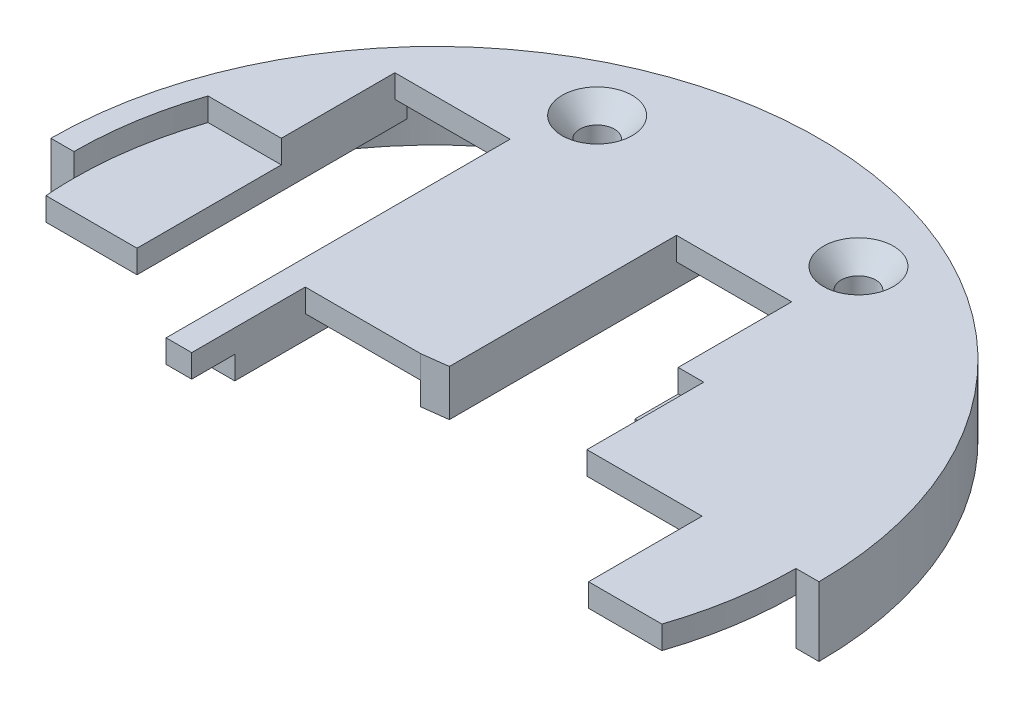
ISO-10303-21;
HEADER;
FILE_DESCRIPTION(('STEP AP214'),'2;1');
FILE_NAME('part.step','',(''),(''),'','','');
FILE_SCHEMA(('AUTOMOTIVE_DESIGN { 1 0 10303 214 1 1 1 1 }'));
ENDSEC;
DATA;
#1=APPLICATION_CONTEXT('core data for automotive mechanical design processes');
#2=APPLICATION_PROTOCOL_DEFINITION('international standard','automotive_design',2000,#1);
#3=PRODUCT_CONTEXT('',#1,'mechanical');
#4=PRODUCT('Part','Part','',(#3));
#5=PRODUCT_RELATED_PRODUCT_CATEGORY('part','',(#4));
#6=PRODUCT_DEFINITION_FORMATION('','',#4);
#7=PRODUCT_DEFINITION_CONTEXT('part definition',#1,'design');
#8=PRODUCT_DEFINITION('design','',#6,#7);
#9=PRODUCT_DEFINITION_SHAPE('','',#8);
#10=(LENGTH_UNIT() NAMED_UNIT(*) SI_UNIT(.MILLI.,.METRE.));
#11=(NAMED_UNIT(*) PLANE_ANGLE_UNIT() SI_UNIT($,.RADIAN.));
#12=(NAMED_UNIT(*) SI_UNIT($,.STERADIAN.) SOLID_ANGLE_UNIT());
#13=UNCERTAINTY_MEASURE_WITH_UNIT(LENGTH_MEASURE(1.E-05),#10,'distance_accuracy_value','');
#14=(GEOMETRIC_REPRESENTATION_CONTEXT(3) GLOBAL_UNCERTAINTY_ASSIGNED_CONTEXT((#13)) GLOBAL_UNIT_ASSIGNED_CONTEXT((#10,
#11,#12)) REPRESENTATION_CONTEXT('',''));
#15=CARTESIAN_POINT('',(0.,0.,0.));
#16=DIRECTION('',(0.,0.,1.));
#17=DIRECTION('',(1.,0.,0.));
#18=AXIS2_PLACEMENT_3D('',#15,#16,#17);
#19=CARTESIAN_POINT('',(0.,-7.5,0.));
#20=DIRECTION('',(0.,1.,0.));
#21=DIRECTION('',(0.,0.,1.));
#22=AXIS2_PLACEMENT_3D('',#19,#20,#21);
#23=CYLINDRICAL_SURFACE('',#22,47.);
#24=DIRECTION('',(0.,-1.,0.));
#25=VECTOR('',#24,1.);
#26=CARTESIAN_POINT('',(47.,1.5,0.));
#27=LINE('',#26,#25);
#28=CARTESIAN_POINT('',(47.,-1.5,0.));
#29=VERTEX_POINT('',#28);
#30=CARTESIAN_POINT('',(47.,-7.5,0.));
#31=VERTEX_POINT('',#30);
#32=EDGE_CURVE('E389',#29,#31,#27,.T.);
#33=ORIENTED_EDGE('',*,*,#32,.F.);
#34=CARTESIAN_POINT('',(-1.47798440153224E-12,-1.5,-2.63677968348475E-13));
#35=DIRECTION('',(0.,1.,0.));
#36=DIRECTION('',(0.,0.,1.));
#37=AXIS2_PLACEMENT_3D('',#34,#35,#36);
#38=CIRCLE('',#37,47.0000000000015);
#39=CARTESIAN_POINT('',(46.8471653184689,-1.5,-3.78722875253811));
#40=VERTEX_POINT('',#39);
#41=EDGE_CURVE('E423',#40,#29,#38,.F.);
#42=ORIENTED_EDGE('',*,*,#41,.F.);
#43=DIRECTION('',(0.,-1.,0.));
#44=VECTOR('',#43,1.);
#45=CARTESIAN_POINT('',(46.8471653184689,20.7913526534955,-3.78722875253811));
#46=LINE('',#45,#44);
#47=CARTESIAN_POINT('',(46.8471653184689,-4.5,-3.78722875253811));
#48=VERTEX_POINT('',#47);
#49=EDGE_CURVE('E417',#40,#48,#46,.T.);
#50=ORIENTED_EDGE('',*,*,#49,.T.);
#51=CARTESIAN_POINT('',(0.,-4.5,0.));
#52=DIRECTION('',(0.,-1.,0.));
#53=DIRECTION('',(0.,0.,-1.));
#54=AXIS2_PLACEMENT_3D('',#51,#52,#53);
#55=CIRCLE('',#54,47.);
#56=CARTESIAN_POINT('',(16.666666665,-4.50000000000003,-43.9456735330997));
#57=VERTEX_POINT('',#56);
#58=EDGE_CURVE('E616',#57,#48,#55,.T.);
#59=ORIENTED_EDGE('',*,*,#58,.F.);
#60=DIRECTION('',(0.,1.,0.));
#61=VECTOR('',#60,1.);
#62=CARTESIAN_POINT('',(16.666666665,-98.5590830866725,-43.9456735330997));
#63=LINE('',#62,#61);
#64=CARTESIAN_POINT('',(16.666666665,-1.5,-43.9456735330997));
#65=VERTEX_POINT('',#64);
#66=EDGE_CURVE('E587',#57,#65,#63,.T.);
#67=ORIENTED_EDGE('',*,*,#66,.T.);
#68=CARTESIAN_POINT('',(0.,-1.5,0.));
#69=DIRECTION('',(0.,1.,0.));
#70=DIRECTION('',(0.,0.,1.));
#71=AXIS2_PLACEMENT_3D('',#68,#69,#70);
#72=CIRCLE('',#71,47.);
#73=CARTESIAN_POINT('',(1.66666666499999,-1.5,-46.9704398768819));
#74=VERTEX_POINT('',#73);
#75=EDGE_CURVE('E726',#65,#74,#72,.T.);
#76=ORIENTED_EDGE('',*,*,#75,.T.);
#77=DIRECTION('',(0.,1.,0.));
#78=VECTOR('',#77,1.);
#79=CARTESIAN_POINT('',(1.66666666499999,-98.5590830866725,-46.9704398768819));
#80=LINE('',#79,#78);
#81=CARTESIAN_POINT('',(1.66666666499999,-4.50000000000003,-46.9704398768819));
#82=VERTEX_POINT('',#81);
#83=EDGE_CURVE('E643',#82,#74,#80,.T.);
#84=ORIENTED_EDGE('',*,*,#83,.F.);
#85=CARTESIAN_POINT('',(0.,-4.5,0.));
#86=DIRECTION('',(0.,-1.,0.));
#87=DIRECTION('',(0.,0.,-1.));
#88=AXIS2_PLACEMENT_3D('',#85,#86,#87);
#89=CIRCLE('',#88,47.);
#90=CARTESIAN_POINT('',(-1.66666666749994,-4.5,-46.9704398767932));
#91=VERTEX_POINT('',#90);
#92=EDGE_CURVE('E630',#91,#82,#89,.T.);
#93=ORIENTED_EDGE('',*,*,#92,.F.);
#94=DIRECTION('',(0.,1.,0.));
#95=VECTOR('',#94,1.);
#96=CARTESIAN_POINT('',(-1.66666666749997,-98.5590830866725,-46.9704398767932));
#97=LINE('',#96,#95);
#98=CARTESIAN_POINT('',(-1.66666666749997,-1.5,-46.9704398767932));
#99=VERTEX_POINT('',#98);
#100=EDGE_CURVE('E640',#91,#99,#97,.T.);
#101=ORIENTED_EDGE('',*,*,#100,.T.);
#102=CARTESIAN_POINT('',(-16.666666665,-1.5,-43.9456735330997));
#103=VERTEX_POINT('',#102);
#104=EDGE_CURVE('E725',#99,#103,#72,.T.);
#105=ORIENTED_EDGE('',*,*,#104,.T.);
#106=DIRECTION('',(0.,1.,0.));
#107=VECTOR('',#106,1.);
#108=CARTESIAN_POINT('',(-16.666666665,-98.5590830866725,-43.9456735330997));
#109=LINE('',#108,#107);
#110=CARTESIAN_POINT('',(-16.666666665,-4.50000000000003,-43.9456735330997));
#111=VERTEX_POINT('',#110);
#112=EDGE_CURVE('E576',#111,#103,#109,.T.);
#113=ORIENTED_EDGE('',*,*,#112,.F.);
#114=CARTESIAN_POINT('',(0.,-4.5,0.));
#115=DIRECTION('',(0.,-1.,0.));
#116=DIRECTION('',(0.,0.,-1.));
#117=AXIS2_PLACEMENT_3D('',#114,#115,#116);
#118=CIRCLE('',#117,47.);
#119=CARTESIAN_POINT('',(-32.6745010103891,-4.5,-33.7842712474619));
#120=VERTEX_POINT('',#119);
#121=EDGE_CURVE('E577',#120,#111,#118,.T.);
#122=ORIENTED_EDGE('',*,*,#121,.F.);
#123=DIRECTION('',(0.,1.,0.));
#124=VECTOR('',#123,1.);
#125=CARTESIAN_POINT('',(-32.6745010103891,-19.9003796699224,-33.7842712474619));
#126=LINE('',#125,#124);
#127=CARTESIAN_POINT('',(-32.6745010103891,-1.5,-33.7842712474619));
#128=VERTEX_POINT('',#127);
#129=EDGE_CURVE('E518',#120,#128,#126,.T.);
#130=ORIENTED_EDGE('',*,*,#129,.T.);
#131=CARTESIAN_POINT('',(-34.9999999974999,-1.5,-31.3687742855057));
#132=VERTEX_POINT('',#131);
#133=EDGE_CURVE('E721',#128,#132,#72,.T.);
#134=ORIENTED_EDGE('',*,*,#133,.T.);
#135=DIRECTION('',(0.,1.,0.));
#136=VECTOR('',#135,1.);
#137=CARTESIAN_POINT('',(-34.9999999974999,-98.5590830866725,-31.3687742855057));
#138=LINE('',#137,#136);
#139=CARTESIAN_POINT('',(-34.9999999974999,-4.50000000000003,-31.3687742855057));
#140=VERTEX_POINT('',#139);
#141=EDGE_CURVE('E607',#140,#132,#138,.T.);
#142=ORIENTED_EDGE('',*,*,#141,.F.);
#143=CARTESIAN_POINT('',(0.,-4.5,0.));
#144=DIRECTION('',(0.,-1.,0.));
#145=DIRECTION('',(0.,0.,-1.));
#146=AXIS2_PLACEMENT_3D('',#143,#144,#145);
#147=CIRCLE('',#146,47.);
#148=CARTESIAN_POINT('',(-47.0000000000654,-4.5,0.));
#149=VERTEX_POINT('',#148);
#150=EDGE_CURVE('E56',#149,#140,#147,.T.);
#151=ORIENTED_EDGE('',*,*,#150,.F.);
#152=DIRECTION('',(0.,-1.,0.));
#153=VECTOR('',#152,1.);
#154=CARTESIAN_POINT('',(-47.,17.460536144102,0.));
#155=LINE('',#154,#153);
#156=CARTESIAN_POINT('',(-47.,-7.5,0.));
#157=VERTEX_POINT('',#156);
#158=EDGE_CURVE('E379',#149,#157,#155,.T.);
#159=ORIENTED_EDGE('',*,*,#158,.T.);
#160=CARTESIAN_POINT('',(0.,-7.5,0.));
#161=DIRECTION('',(0.,-1.,0.));
#162=DIRECTION('',(0.,0.,-1.));
#163=AXIS2_PLACEMENT_3D('',#160,#161,#162);
#164=CIRCLE('',#163,47.);
#165=EDGE_CURVE('E358',#157,#31,#164,.T.);
#166=ORIENTED_EDGE('',*,*,#165,.T.);
#167=EDGE_LOOP('',(#33,#42,#50,#59,#67,#76,#84,#93,#101,#105,#113,#122,#130,#134,#142,#151,#159,#166));
#168=FACE_BOUND('',#167,.T.);
#169=ADVANCED_FACE('F33',(#168),#23,.F.);
#170=CARTESIAN_POINT('',(-1.66666666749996,1.5,29.7842712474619));
#171=DIRECTION('',(1.,0.,0.));
#172=DIRECTION('',(0.,0.,-1.));
#173=AXIS2_PLACEMENT_3D('',#170,#171,#172);
#174=PLANE('',#173);
#175=DIRECTION('',(0.,1.,0.));
#176=VECTOR('',#175,1.);
#177=CARTESIAN_POINT('',(-1.66666666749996,-7.5,0.212771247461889));
#178=LINE('',#177,#176);
#179=CARTESIAN_POINT('',(-1.66666666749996,-4.5,0.212771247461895));
#180=VERTEX_POINT('',#179);
#181=CARTESIAN_POINT('',(-1.66666666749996,-1.5,0.212771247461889));
#182=VERTEX_POINT('',#181);
#183=EDGE_CURVE('E493',#180,#182,#178,.T.);
#184=ORIENTED_EDGE('',*,*,#183,.T.);
#185=DIRECTION('',(0.,0.,-1.));
#186=VECTOR('',#185,1.);
#187=CARTESIAN_POINT('',(-1.66666666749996,-1.5,46.9704398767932));
#188=LINE('',#187,#186);
#189=CARTESIAN_POINT('',(-1.66666666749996,-1.5,-3.78722875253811));
#190=VERTEX_POINT('',#189);
#191=EDGE_CURVE('E629',#182,#190,#188,.T.);
#192=ORIENTED_EDGE('',*,*,#191,.T.);
#193=DIRECTION('',(0.,1.,0.));
#194=VECTOR('',#193,1.);
#195=CARTESIAN_POINT('',(-1.66666666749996,-19.9003796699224,-3.78722875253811));
#196=LINE('',#195,#194);
#197=CARTESIAN_POINT('',(-1.66666666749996,-4.5,-3.78722875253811));
#198=VERTEX_POINT('',#197);
#199=EDGE_CURVE('E553',#198,#190,#196,.T.);
#200=ORIENTED_EDGE('',*,*,#199,.F.);
#201=DIRECTION('',(0.,0.,-1.));
#202=VECTOR('',#201,1.);
#203=CARTESIAN_POINT('',(-1.66666666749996,-4.5,46.9704398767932));
#204=LINE('',#203,#202);
#205=EDGE_CURVE('E634',#180,#198,#204,.T.);
#206=ORIENTED_EDGE('',*,*,#205,.F.);
#207=EDGE_LOOP('',(#184,#192,#200,#206));
#208=FACE_BOUND('',#207,.T.);
#209=ADVANCED_FACE('F747',(#208),#174,.F.);
#210=CARTESIAN_POINT('',(-16.6666666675,1.5,29.7842712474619));
#211=DIRECTION('',(-1.,0.,0.));
#212=DIRECTION('',(0.,0.,1.));
#213=AXIS2_PLACEMENT_3D('',#210,#211,#212);
#214=PLANE('',#213);
#215=DIRECTION('',(0.,1.,0.));
#216=VECTOR('',#215,1.);
#217=CARTESIAN_POINT('',(-16.6666666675,-7.5,14.9985212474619));
#218=LINE('',#217,#216);
#219=CARTESIAN_POINT('',(-16.6666666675,-1.5,14.9985212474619));
#220=VERTEX_POINT('',#219);
#221=CARTESIAN_POINT('',(-16.6666666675,1.5,14.9985212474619));
#222=VERTEX_POINT('',#221);
#223=EDGE_CURVE('E491',#220,#222,#218,.T.);
#224=ORIENTED_EDGE('',*,*,#223,.F.);
#225=DIRECTION('',(0.,0.,1.));
#226=VECTOR('',#225,1.);
#227=CARTESIAN_POINT('',(-16.6666666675,-1.5,9.39287499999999));
#228=LINE('',#227,#226);
#229=CARTESIAN_POINT('',(-16.6666666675,-1.5,9.39287499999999));
#230=VERTEX_POINT('',#229);
#231=EDGE_CURVE('E412',#230,#220,#228,.T.);
#232=ORIENTED_EDGE('',*,*,#231,.F.);
#233=DIRECTION('',(0.,-1.,0.));
#234=VECTOR('',#233,1.);
#235=CARTESIAN_POINT('',(-16.6666666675,20.7913526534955,9.39287499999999));
#236=LINE('',#235,#234);
#237=CARTESIAN_POINT('',(-16.6666666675,-4.5,9.39287499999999));
#238=VERTEX_POINT('',#237);
#239=EDGE_CURVE('E405',#230,#238,#236,.T.);
#240=ORIENTED_EDGE('',*,*,#239,.T.);
#241=DIRECTION('',(0.,0.,1.));
#242=VECTOR('',#241,1.);
#243=CARTESIAN_POINT('',(-16.666666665,-4.5,34.1427403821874));
#244=LINE('',#243,#242);
#245=CARTESIAN_POINT('',(-16.666666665,-4.5,-3.78722875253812));
#246=VERTEX_POINT('',#245);
#247=EDGE_CURVE('E608',#246,#238,#244,.T.);
#248=ORIENTED_EDGE('',*,*,#247,.F.);
#249=DIRECTION('',(0.,1.,0.));
#250=VECTOR('',#249,1.);
#251=CARTESIAN_POINT('',(-16.666666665,-19.9003796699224,-3.78722875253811));
#252=LINE('',#251,#250);
#253=CARTESIAN_POINT('',(-16.666666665,-1.5,-3.78722875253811));
#254=VERTEX_POINT('',#253);
#255=EDGE_CURVE('E552',#246,#254,#252,.T.);
#256=ORIENTED_EDGE('',*,*,#255,.T.);
#257=DIRECTION('',(0.,0.,1.));
#258=VECTOR('',#257,1.);
#259=CARTESIAN_POINT('',(-16.666666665,-1.5,34.1427403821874));
#260=LINE('',#259,#258);
#261=CARTESIAN_POINT('',(-16.666666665,-1.5,0.212771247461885));
#262=VERTEX_POINT('',#261);
#263=EDGE_CURVE('E603',#254,#262,#260,.T.);
#264=ORIENTED_EDGE('',*,*,#263,.T.);
#265=DIRECTION('',(0.,-1.,0.));
#266=VECTOR('',#265,1.);
#267=CARTESIAN_POINT('',(-16.6666666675,1.5,0.212771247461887));
#268=LINE('',#267,#266);
#269=CARTESIAN_POINT('',(-16.6666666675,1.5,0.212771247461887));
#270=VERTEX_POINT('',#269);
#271=EDGE_CURVE('E681',#270,#262,#268,.T.);
#272=ORIENTED_EDGE('',*,*,#271,.F.);
#273=DIRECTION('',(0.,0.,-1.));
#274=VECTOR('',#273,1.);
#275=CARTESIAN_POINT('',(-16.6666666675,1.5,29.7842712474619));
#276=LINE('',#275,#274);
#277=EDGE_CURVE('E676',#222,#270,#276,.T.);
#278=ORIENTED_EDGE('',*,*,#277,.F.);
#279=EDGE_LOOP('',(#224,#232,#240,#248,#256,#264,#272,#278));
#280=FACE_BOUND('',#279,.T.);
#281=ADVANCED_FACE('F761',(#280),#214,.F.);
#282=CARTESIAN_POINT('',(16.666666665,1.5,-0.212771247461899));
#283=DIRECTION('',(1.,0.,0.));
#284=DIRECTION('',(0.,0.,-1.));
#285=AXIS2_PLACEMENT_3D('',#282,#283,#284);
#286=PLANE('',#285);
#287=DIRECTION('',(0.,0.,-1.));
#288=VECTOR('',#287,1.);
#289=CARTESIAN_POINT('',(16.666666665,-4.5,34.1427403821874));
#290=LINE('',#289,#288);
#291=CARTESIAN_POINT('',(16.666666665,-4.5,-9.392875));
#292=VERTEX_POINT('',#291);
#293=CARTESIAN_POINT('',(16.666666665,-4.5,-33.7842712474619));
#294=VERTEX_POINT('',#293);
#295=EDGE_CURVE('E648',#292,#294,#290,.T.);
#296=ORIENTED_EDGE('',*,*,#295,.F.);
#297=DIRECTION('',(0.,-1.,0.));
#298=VECTOR('',#297,1.);
#299=CARTESIAN_POINT('',(16.666666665,20.7913526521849,-9.392875));
#300=LINE('',#299,#298);
#301=CARTESIAN_POINT('',(16.666666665,-1.5,-9.392875));
#302=VERTEX_POINT('',#301);
#303=EDGE_CURVE('E437',#302,#292,#300,.T.);
#304=ORIENTED_EDGE('',*,*,#303,.F.);
#305=DIRECTION('',(0.,0.,-1.));
#306=VECTOR('',#305,1.);
#307=CARTESIAN_POINT('',(16.666666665,-1.5,-14.9985212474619));
#308=LINE('',#307,#306);
#309=CARTESIAN_POINT('',(16.666666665,-1.5,-14.9985212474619));
#310=VERTEX_POINT('',#309);
#311=EDGE_CURVE('E434',#302,#310,#308,.T.);
#312=ORIENTED_EDGE('',*,*,#311,.T.);
#313=DIRECTION('',(0.,1.,0.));
#314=VECTOR('',#313,1.);
#315=CARTESIAN_POINT('',(16.666666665,-7.5,-14.9985212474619));
#316=LINE('',#315,#314);
#317=CARTESIAN_POINT('',(16.666666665,1.5,-14.9985212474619));
#318=VERTEX_POINT('',#317);
#319=EDGE_CURVE('E496',#310,#318,#316,.T.);
#320=ORIENTED_EDGE('',*,*,#319,.T.);
#321=DIRECTION('',(0.,0.,1.));
#322=VECTOR('',#321,1.);
#323=CARTESIAN_POINT('',(16.666666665,1.5,-0.212771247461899));
#324=LINE('',#323,#322);
#325=CARTESIAN_POINT('',(16.666666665,1.5,-29.7842712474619));
#326=VERTEX_POINT('',#325);
#327=EDGE_CURVE('E689',#326,#318,#324,.T.);
#328=ORIENTED_EDGE('',*,*,#327,.F.);
#329=DIRECTION('',(0.,-1.,0.));
#330=VECTOR('',#329,1.);
#331=CARTESIAN_POINT('',(16.666666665,1.5,-29.7842712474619));
#332=LINE('',#331,#330);
#333=CARTESIAN_POINT('',(16.666666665,-1.5,-29.7842712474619));
#334=VERTEX_POINT('',#333);
#335=EDGE_CURVE('E701',#326,#334,#332,.T.);
#336=ORIENTED_EDGE('',*,*,#335,.T.);
#337=DIRECTION('',(0.,0.,-1.));
#338=VECTOR('',#337,1.);
#339=CARTESIAN_POINT('',(16.666666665,-1.5,34.1427403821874));
#340=LINE('',#339,#338);
#341=CARTESIAN_POINT('',(16.666666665,-1.5,-33.7842712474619));
#342=VERTEX_POINT('',#341);
#343=EDGE_CURVE('E633',#334,#342,#340,.T.);
#344=ORIENTED_EDGE('',*,*,#343,.T.);
#345=DIRECTION('',(0.,1.,0.));
#346=VECTOR('',#345,1.);
#347=CARTESIAN_POINT('',(16.666666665,-19.9003796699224,-33.7842712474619));
#348=LINE('',#347,#346);
#349=EDGE_CURVE('E523',#294,#342,#348,.T.);
#350=ORIENTED_EDGE('',*,*,#349,.F.);
#351=EDGE_LOOP('',(#296,#304,#312,#320,#328,#336,#344,#350));
#352=FACE_BOUND('',#351,.T.);
#353=ADVANCED_FACE('F888',(#352),#286,.F.);
#354=CARTESIAN_POINT('',(-34.9999999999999,1.5,-0.212771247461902));
#355=DIRECTION('',(-1.,0.,0.));
#356=DIRECTION('',(0.,0.,1.));
#357=AXIS2_PLACEMENT_3D('',#354,#355,#356);
#358=PLANE('',#357);
#359=DIRECTION('',(0.,1.,0.));
#360=VECTOR('',#359,1.);
#361=CARTESIAN_POINT('',(-34.9999999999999,-7.5,-14.9985212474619));
#362=LINE('',#361,#360);
#363=CARTESIAN_POINT('',(-34.9999999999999,-1.5,-14.9985212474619));
#364=VERTEX_POINT('',#363);
#365=CARTESIAN_POINT('',(-34.9999999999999,1.5,-14.9985212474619));
#366=VERTEX_POINT('',#365);
#367=EDGE_CURVE('E486',#364,#366,#362,.T.);
#368=ORIENTED_EDGE('',*,*,#367,.F.);
#369=DIRECTION('',(0.,0.,1.));
#370=VECTOR('',#369,1.);
#371=CARTESIAN_POINT('',(-34.9999999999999,-1.5,-14.9985212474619));
#372=LINE('',#371,#370);
#373=CARTESIAN_POINT('',(-34.9999999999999,-1.5,3.78722875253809));
#374=VERTEX_POINT('',#373);
#375=EDGE_CURVE('E451',#364,#374,#372,.T.);
#376=ORIENTED_EDGE('',*,*,#375,.T.);
#377=DIRECTION('',(0.,-1.,0.));
#378=VECTOR('',#377,1.);
#379=CARTESIAN_POINT('',(-34.9999999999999,20.7913526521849,3.78722875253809));
#380=LINE('',#379,#378);
#381=CARTESIAN_POINT('',(-34.9999999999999,-4.5,3.78722875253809));
#382=VERTEX_POINT('',#381);
#383=EDGE_CURVE('E456',#374,#382,#380,.T.);
#384=ORIENTED_EDGE('',*,*,#383,.T.);
#385=DIRECTION('',(0.,0.,1.));
#386=VECTOR('',#385,1.);
#387=CARTESIAN_POINT('',(-34.9999999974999,-4.5,31.3687742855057));
#388=LINE('',#387,#386);
#389=EDGE_CURVE('E614',#140,#382,#388,.T.);
#390=ORIENTED_EDGE('',*,*,#389,.F.);
#391=ORIENTED_EDGE('',*,*,#141,.T.);
#392=DIRECTION('',(0.,0.,1.));
#393=VECTOR('',#392,1.);
#394=CARTESIAN_POINT('',(-34.9999999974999,-1.5,31.3687742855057));
#395=LINE('',#394,#393);
#396=CARTESIAN_POINT('',(-34.9999999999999,-1.5,-29.7842712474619));
#397=VERTEX_POINT('',#396);
#398=EDGE_CURVE('E612',#132,#397,#395,.T.);
#399=ORIENTED_EDGE('',*,*,#398,.T.);
#400=DIRECTION('',(0.,-1.,0.));
#401=VECTOR('',#400,1.);
#402=CARTESIAN_POINT('',(-34.9999999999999,1.5,-29.7842712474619));
#403=LINE('',#402,#401);
#404=CARTESIAN_POINT('',(-34.9999999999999,1.5,-29.7842712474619));
#405=VERTEX_POINT('',#404);
#406=EDGE_CURVE('E667',#405,#397,#403,.T.);
#407=ORIENTED_EDGE('',*,*,#406,.F.);
#408=DIRECTION('',(0.,0.,-1.));
#409=VECTOR('',#408,1.);
#410=CARTESIAN_POINT('',(-34.9999999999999,1.5,-0.212771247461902));
#411=LINE('',#410,#409);
#412=EDGE_CURVE('E662',#366,#405,#411,.T.);
#413=ORIENTED_EDGE('',*,*,#412,.F.);
#414=EDGE_LOOP('',(#368,#376,#384,#390,#391,#399,#407,#413));
#415=FACE_BOUND('',#414,.T.);
#416=ADVANCED_FACE('F884',(#415),#358,.F.);
#417=CARTESIAN_POINT('',(34.9999999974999,1.5,29.7842712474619));
#418=DIRECTION('',(1.,0.,0.));
#419=DIRECTION('',(0.,0.,-1.));
#420=AXIS2_PLACEMENT_3D('',#417,#418,#419);
#421=PLANE('',#420);
#422=DIRECTION('',(0.,-1.,0.));
#423=VECTOR('',#422,1.);
#424=CARTESIAN_POINT('',(34.9999999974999,1.5,0.212771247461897));
#425=LINE('',#424,#423);
#426=CARTESIAN_POINT('',(34.9999999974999,1.5,0.212771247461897));
#427=VERTEX_POINT('',#426);
#428=CARTESIAN_POINT('',(34.9999999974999,-1.5,0.212771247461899));
#429=VERTEX_POINT('',#428);
#430=EDGE_CURVE('E718',#427,#429,#425,.T.);
#431=ORIENTED_EDGE('',*,*,#430,.T.);
#432=DIRECTION('',(0.,0.,-1.));
#433=VECTOR('',#432,1.);
#434=CARTESIAN_POINT('',(34.9999999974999,-1.5,14.9985212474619));
#435=LINE('',#434,#433);
#436=CARTESIAN_POINT('',(34.9999999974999,-1.5,14.9985212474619));
#437=VERTEX_POINT('',#436);
#438=EDGE_CURVE('E418',#437,#429,#435,.T.);
#439=ORIENTED_EDGE('',*,*,#438,.F.);
#440=DIRECTION('',(0.,1.,0.));
#441=VECTOR('',#440,1.);
#442=CARTESIAN_POINT('',(34.9999999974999,-7.5,14.9985212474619));
#443=LINE('',#442,#441);
#444=CARTESIAN_POINT('',(34.9999999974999,1.5,14.9985212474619));
#445=VERTEX_POINT('',#444);
#446=EDGE_CURVE('E485',#437,#445,#443,.T.);
#447=ORIENTED_EDGE('',*,*,#446,.T.);
#448=DIRECTION('',(0.,0.,1.));
#449=VECTOR('',#448,1.);
#450=CARTESIAN_POINT('',(34.9999999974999,1.5,29.7842712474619));
#451=LINE('',#450,#449);
#452=EDGE_CURVE('E709',#427,#445,#451,.T.);
#453=ORIENTED_EDGE('',*,*,#452,.F.);
#454=EDGE_LOOP('',(#431,#439,#447,#453));
#455=FACE_BOUND('',#454,.T.);
#456=ADVANCED_FACE('F887',(#455),#421,.F.);
#457=CARTESIAN_POINT('',(0.,1.5,0.));
#458=DIRECTION('',(0.,1.,0.));
#459=DIRECTION('',(0.,0.,1.));
#460=AXIS2_PLACEMENT_3D('',#457,#458,#459);
#461=PLANE('',#460);
#462=CARTESIAN_POINT('',(-3.48332473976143E-12,1.5,-5.65519853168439E-13));
#463=DIRECTION('',(0.,1.,0.));
#464=DIRECTION('',(0.,0.,-1.));
#465=AXIS2_PLACEMENT_3D('',#462,#463,#464);
#466=CIRCLE('',#465,47.0000000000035);
#467=CARTESIAN_POINT('',(44.5426128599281,1.5,14.9985212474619));
#468=VERTEX_POINT('',#467);
#469=CARTESIAN_POINT('',(47.,1.5,0.));
#470=VERTEX_POINT('',#469);
#471=EDGE_CURVE('E383',#468,#470,#466,.T.);
#472=ORIENTED_EDGE('',*,*,#471,.T.);
#473=DIRECTION('',(1.,0.,0.));
#474=VECTOR('',#473,1.);
#475=CARTESIAN_POINT('',(47.,1.5,0.));
#476=LINE('',#475,#474);
#477=CARTESIAN_POINT('',(50.,1.5,0.));
#478=VERTEX_POINT('',#477);
#479=EDGE_CURVE('E386',#470,#478,#476,.T.);
#480=ORIENTED_EDGE('',*,*,#479,.T.);
#481=CARTESIAN_POINT('',(0.,1.5,0.));
#482=DIRECTION('',(0.,1.,0.));
#483=DIRECTION('',(0.,0.,1.));
#484=AXIS2_PLACEMENT_3D('',#481,#482,#483);
#485=CIRCLE('',#484,50.);
#486=CARTESIAN_POINT('',(-50.,1.5,0.));
#487=VERTEX_POINT('',#486);
#488=EDGE_CURVE('E652',#487,#478,#485,.F.);
#489=ORIENTED_EDGE('',*,*,#488,.F.);
#490=DIRECTION('',(-1.,0.,0.));
#491=VECTOR('',#490,1.);
#492=CARTESIAN_POINT('',(-50.,1.5,0.));
#493=LINE('',#492,#491);
#494=CARTESIAN_POINT('',(-47.,1.5,0.));
#495=VERTEX_POINT('',#494);
#496=EDGE_CURVE('E366',#495,#487,#493,.T.);
#497=ORIENTED_EDGE('',*,*,#496,.F.);
#498=CARTESIAN_POINT('',(0.,1.5,0.));
#499=DIRECTION('',(0.,1.,0.));
#500=DIRECTION('',(0.,0.,1.));
#501=AXIS2_PLACEMENT_3D('',#498,#499,#500);
#502=CIRCLE('',#501,47.);
#503=CARTESIAN_POINT('',(-44.5426128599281,1.5,-14.9985212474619));
#504=VERTEX_POINT('',#503);
#505=EDGE_CURVE('E373',#504,#495,#502,.T.);
#506=ORIENTED_EDGE('',*,*,#505,.F.);
#507=DIRECTION('',(1.,0.,0.));
#508=VECTOR('',#507,1.);
#509=CARTESIAN_POINT('',(0.,1.5,-14.9985212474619));
#510=LINE('',#509,#508);
#511=EDGE_CURVE('E48',#504,#366,#510,.T.);
#512=ORIENTED_EDGE('',*,*,#511,.T.);
#513=ORIENTED_EDGE('',*,*,#412,.T.);
#514=DIRECTION('',(1.,0.,0.));
#515=VECTOR('',#514,1.);
#516=CARTESIAN_POINT('',(-19.9999999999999,1.5,-29.7842712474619));
#517=LINE('',#516,#515);
#518=CARTESIAN_POINT('',(-19.9999999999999,1.5,-29.7842712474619));
#519=VERTEX_POINT('',#518);
#520=EDGE_CURVE('E664',#405,#519,#517,.T.);
#521=ORIENTED_EDGE('',*,*,#520,.T.);
#522=DIRECTION('',(0.,0.,1.));
#523=VECTOR('',#522,1.);
#524=CARTESIAN_POINT('',(-19.9999999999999,1.5,-0.2127712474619));
#525=LINE('',#524,#523);
#526=CARTESIAN_POINT('',(-19.9999999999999,1.5,14.9985212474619));
#527=VERTEX_POINT('',#526);
#528=EDGE_CURVE('E659',#519,#527,#525,.T.);
#529=ORIENTED_EDGE('',*,*,#528,.T.);
#530=DIRECTION('',(1.,0.,0.));
#531=VECTOR('',#530,1.);
#532=CARTESIAN_POINT('',(0.,1.5,14.9985212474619));
#533=LINE('',#532,#531);
#534=EDGE_CURVE('E481',#527,#222,#533,.T.);
#535=ORIENTED_EDGE('',*,*,#534,.T.);
#536=ORIENTED_EDGE('',*,*,#277,.T.);
#537=DIRECTION('',(1.,0.,0.));
#538=VECTOR('',#537,1.);
#539=CARTESIAN_POINT('',(-1.66666666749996,1.5,0.212771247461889));
#540=LINE('',#539,#538);
#541=CARTESIAN_POINT('',(-1.66666666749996,1.5,0.212771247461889));
#542=VERTEX_POINT('',#541);
#543=EDGE_CURVE('E678',#270,#542,#540,.T.);
#544=ORIENTED_EDGE('',*,*,#543,.T.);
#545=DIRECTION('',(0.991949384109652,0.,-0.126634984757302));
#546=VECTOR('',#545,1.);
#547=CARTESIAN_POINT('',(-2.00458575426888E-11,1.5,-1.57021979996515E-10));
#548=LINE('',#547,#546);
#549=CARTESIAN_POINT('',(1.66666666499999,1.5,-0.212771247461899));
#550=VERTEX_POINT('',#549);
#551=EDGE_CURVE('E478',#542,#550,#548,.T.);
#552=ORIENTED_EDGE('',*,*,#551,.T.);
#553=DIRECTION('',(0.,0.,-1.));
#554=VECTOR('',#553,1.);
#555=CARTESIAN_POINT('',(1.66666666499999,1.5,-0.212771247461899));
#556=LINE('',#555,#554);
#557=CARTESIAN_POINT('',(1.666666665,1.5,-29.7842712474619));
#558=VERTEX_POINT('',#557);
#559=EDGE_CURVE('E692',#550,#558,#556,.T.);
#560=ORIENTED_EDGE('',*,*,#559,.T.);
#561=DIRECTION('',(1.,0.,0.));
#562=VECTOR('',#561,1.);
#563=CARTESIAN_POINT('',(16.666666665,1.5,-29.7842712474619));
#564=LINE('',#563,#562);
#565=EDGE_CURVE('E695',#558,#326,#564,.T.);
#566=ORIENTED_EDGE('',*,*,#565,.T.);
#567=ORIENTED_EDGE('',*,*,#327,.T.);
#568=DIRECTION('',(1.,0.,0.));
#569=VECTOR('',#568,1.);
#570=CARTESIAN_POINT('',(0.,1.5,-14.9985212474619));
#571=LINE('',#570,#569);
#572=CARTESIAN_POINT('',(19.9999999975,1.5,-14.9985212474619));
#573=VERTEX_POINT('',#572);
#574=EDGE_CURVE('E475',#318,#573,#571,.T.);
#575=ORIENTED_EDGE('',*,*,#574,.T.);
#576=DIRECTION('',(0.,0.,-1.));
#577=VECTOR('',#576,1.);
#578=CARTESIAN_POINT('',(19.9999999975,1.5,0.));
#579=LINE('',#578,#577);
#580=CARTESIAN_POINT('',(19.9999999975,1.5,0.212771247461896));
#581=VERTEX_POINT('',#580);
#582=EDGE_CURVE('E472',#581,#573,#579,.T.);
#583=ORIENTED_EDGE('',*,*,#582,.F.);
#584=DIRECTION('',(1.,0.,0.));
#585=VECTOR('',#584,1.);
#586=CARTESIAN_POINT('',(34.9999999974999,1.5,0.212771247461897));
#587=LINE('',#586,#585);
#588=EDGE_CURVE('E712',#581,#427,#587,.T.);
#589=ORIENTED_EDGE('',*,*,#588,.T.);
#590=ORIENTED_EDGE('',*,*,#452,.T.);
#591=DIRECTION('',(1.,0.,0.));
#592=VECTOR('',#591,1.);
#593=CARTESIAN_POINT('',(0.,1.5,14.9985212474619));
#594=LINE('',#593,#592);
#595=EDGE_CURVE('E459',#445,#468,#594,.T.);
#596=ORIENTED_EDGE('',*,*,#595,.T.);
#597=EDGE_LOOP('',(#472,#480,#489,#497,#506,#512,#513,#521,#529,#535,#536,#544,#552,#560,#566,
#567,#575,#583,#589,#590,#596));
#598=FACE_BOUND('',#597,.T.);
#599=CARTESIAN_POINT('',(17.009259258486,1.5,-38.1280421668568));
#600=DIRECTION('',(0.,1.,0.));
#601=DIRECTION('',(0.,0.,1.));
#602=AXIS2_PLACEMENT_3D('',#599,#600,#601);
#603=CIRCLE('',#602,4.5593);
#604=CARTESIAN_POINT('',(17.009259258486,1.5,-33.5687421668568));
#605=VERTEX_POINT('',#604);
#606=EDGE_CURVE('E509',#605,#605,#603,.T.);
#607=ORIENTED_EDGE('',*,*,#606,.F.);
#608=EDGE_LOOP('',(#607));
#609=FACE_BOUND('',#608,.T.);
#610=CARTESIAN_POINT('',(-17.009259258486,1.5,-38.1280421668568));
#611=DIRECTION('',(0.,1.,0.));
#612=DIRECTION('',(0.,0.,1.));
#613=AXIS2_PLACEMENT_3D('',#610,#611,#612);
#614=CIRCLE('',#613,4.5593);
#615=CARTESIAN_POINT('',(-17.009259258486,1.5,-33.5687421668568));
#616=VERTEX_POINT('',#615);
#617=EDGE_CURVE('E502',#616,#616,#614,.T.);
#618=ORIENTED_EDGE('',*,*,#617,.F.);
#619=EDGE_LOOP('',(#618));
#620=FACE_BOUND('',#619,.T.);
#621=ADVANCED_FACE('F769',(#598,#609,#620),#461,.T.);
#622=CARTESIAN_POINT('',(17.0092592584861,-4.5,38.1280421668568));
#623=DIRECTION('',(0.,-1.,0.));
#624=DIRECTION('',(0.,0.,-1.));
#625=AXIS2_PLACEMENT_3D('',#622,#623,#624);
#626=PLANE('',#625);
#627=ORIENTED_EDGE('',*,*,#389,.T.);
#628=DIRECTION('',(-1.,0.,0.));
#629=VECTOR('',#628,1.);
#630=CARTESIAN_POINT('',(-34.9999999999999,-4.5,3.78722875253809));
#631=LINE('',#630,#629);
#632=CARTESIAN_POINT('',(-46.8471653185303,-4.5,3.78722875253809));
#633=VERTEX_POINT('',#632);
#634=EDGE_CURVE('E436',#382,#633,#631,.T.);
#635=ORIENTED_EDGE('',*,*,#634,.T.);
#636=CARTESIAN_POINT('',(-1.24998297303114E-09,-4.5,0.));
#637=DIRECTION('',(0.,-1.,0.));
#638=DIRECTION('',(0.,0.,1.));
#639=AXIS2_PLACEMENT_3D('',#636,#637,#638);
#640=CIRCLE('',#639,46.9999999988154);
#641=EDGE_CURVE('E448',#633,#149,#640,.T.);
#642=ORIENTED_EDGE('',*,*,#641,.T.);
#643=ORIENTED_EDGE('',*,*,#150,.T.);
#644=EDGE_LOOP('',(#627,#635,#642,#643));
#645=FACE_BOUND('',#644,.T.);
#646=ADVANCED_FACE('F876',(#645),#626,.T.);
#647=DIRECTION('',(1.,0.,0.));
#648=VECTOR('',#647,1.);
#649=CARTESIAN_POINT('',(-19.9999999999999,-4.5,9.39287499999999));
#650=LINE('',#649,#648);
#651=CARTESIAN_POINT('',(-19.9999999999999,-4.5,9.39287499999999));
#652=VERTEX_POINT('',#651);
#653=EDGE_CURVE('E400',#652,#238,#650,.T.);
#654=ORIENTED_EDGE('',*,*,#653,.F.);
#655=DIRECTION('',(0.,0.,-1.));
#656=VECTOR('',#655,1.);
#657=CARTESIAN_POINT('',(-19.9999999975,-4.5,-35.4718287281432));
#658=LINE('',#657,#656);
#659=CARTESIAN_POINT('',(-19.9999999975,-4.5,-33.7842712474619));
#660=VERTEX_POINT('',#659);
#661=EDGE_CURVE('E599',#652,#660,#658,.T.);
#662=ORIENTED_EDGE('',*,*,#661,.T.);
#663=DIRECTION('',(-1.,0.,0.));
#664=VECTOR('',#663,1.);
#665=CARTESIAN_POINT('',(-19.9999999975,-4.5,-33.7842712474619));
#666=LINE('',#665,#664);
#667=EDGE_CURVE('E520',#660,#120,#666,.T.);
#668=ORIENTED_EDGE('',*,*,#667,.T.);
#669=ORIENTED_EDGE('',*,*,#121,.T.);
#670=DIRECTION('',(0.,0.,1.));
#671=VECTOR('',#670,1.);
#672=CARTESIAN_POINT('',(-16.666666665,-4.5,-42.1133439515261));
#673=LINE('',#672,#671);
#674=CARTESIAN_POINT('',(-16.666666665,-4.5,-42.1133439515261));
#675=VERTEX_POINT('',#674);
#676=EDGE_CURVE('E575',#111,#675,#673,.T.);
#677=ORIENTED_EDGE('',*,*,#676,.T.);
#678=CARTESIAN_POINT('',(-17.009259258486,-4.5,-38.1280421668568));
#679=DIRECTION('',(0.,-1.,0.));
#680=DIRECTION('',(0.,0.,-1.));
#681=AXIS2_PLACEMENT_3D('',#678,#679,#680);
#682=CIRCLE('',#681,4.);
#683=CARTESIAN_POINT('',(-16.666666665,-4.50000000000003,-34.1427403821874));
#684=VERTEX_POINT('',#683);
#685=EDGE_CURVE('E357',#675,#684,#682,.T.);
#686=ORIENTED_EDGE('',*,*,#685,.T.);
#687=CARTESIAN_POINT('',(-16.666666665,-4.5,-6.78722875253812));
#688=VERTEX_POINT('',#687);
#689=EDGE_CURVE('E604',#684,#688,#244,.T.);
#690=ORIENTED_EDGE('',*,*,#689,.T.);
#691=DIRECTION('',(1.,0.,0.));
#692=VECTOR('',#691,1.);
#693=CARTESIAN_POINT('',(-1.66666666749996,-4.5,-6.78722875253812));
#694=LINE('',#693,#692);
#695=CARTESIAN_POINT('',(-1.66666666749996,-4.5,-6.78722875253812));
#696=VERTEX_POINT('',#695);
#697=EDGE_CURVE('E548',#688,#696,#694,.T.);
#698=ORIENTED_EDGE('',*,*,#697,.T.);
#699=EDGE_CURVE('E636',#696,#91,#204,.T.);
#700=ORIENTED_EDGE('',*,*,#699,.T.);
#701=ORIENTED_EDGE('',*,*,#92,.T.);
#702=DIRECTION('',(0.,0.,1.));
#703=VECTOR('',#702,1.);
#704=CARTESIAN_POINT('',(1.66666666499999,-4.5,46.9704398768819));
#705=LINE('',#704,#703);
#706=CARTESIAN_POINT('',(1.66666666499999,-4.5,-36.7842712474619));
#707=VERTEX_POINT('',#706);
#708=EDGE_CURVE('E637',#82,#707,#705,.T.);
#709=ORIENTED_EDGE('',*,*,#708,.T.);
#710=DIRECTION('',(1.,0.,0.));
#711=VECTOR('',#710,1.);
#712=CARTESIAN_POINT('',(1.66666666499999,-4.5,-36.7842712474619));
#713=LINE('',#712,#711);
#714=CARTESIAN_POINT('',(13.2417296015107,-4.5,-36.7842712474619));
#715=VERTEX_POINT('',#714);
#716=EDGE_CURVE('E534',#707,#715,#713,.T.);
#717=ORIENTED_EDGE('',*,*,#716,.T.);
#718=CARTESIAN_POINT('',(17.009259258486,-4.5,-38.1280421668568));
#719=DIRECTION('',(0.,-1.,0.));
#720=DIRECTION('',(0.,0.,-1.));
#721=AXIS2_PLACEMENT_3D('',#718,#719,#720);
#722=CIRCLE('',#721,4.);
#723=CARTESIAN_POINT('',(16.666666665,-4.50000000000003,-42.1133439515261));
#724=VERTEX_POINT('',#723);
#725=EDGE_CURVE('E656',#715,#724,#722,.T.);
#726=ORIENTED_EDGE('',*,*,#725,.T.);
#727=DIRECTION('',(0.,0.,-1.));
#728=VECTOR('',#727,1.);
#729=CARTESIAN_POINT('',(16.666666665,-4.5,-42.1133439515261));
#730=LINE('',#729,#728);
#731=EDGE_CURVE('E588',#724,#57,#730,.T.);
#732=ORIENTED_EDGE('',*,*,#731,.T.);
#733=ORIENTED_EDGE('',*,*,#58,.T.);
#734=DIRECTION('',(-1.,0.,0.));
#735=VECTOR('',#734,1.);
#736=CARTESIAN_POINT('',(34.9999999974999,-4.5,-3.7872287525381));
#737=LINE('',#736,#735);
#738=CARTESIAN_POINT('',(19.9999999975,-4.5,-3.7872287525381));
#739=VERTEX_POINT('',#738);
#740=EDGE_CURVE('E568',#48,#739,#737,.T.);
#741=ORIENTED_EDGE('',*,*,#740,.T.);
#742=DIRECTION('',(0.,0.,1.));
#743=VECTOR('',#742,1.);
#744=CARTESIAN_POINT('',(19.9999999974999,-4.5,38.1280421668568));
#745=LINE('',#744,#743);
#746=CARTESIAN_POINT('',(19.9999999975,-4.5,-9.392875));
#747=VERTEX_POINT('',#746);
#748=EDGE_CURVE('E488',#747,#739,#745,.T.);
#749=ORIENTED_EDGE('',*,*,#748,.F.);
#750=DIRECTION('',(-1.,0.,0.));
#751=VECTOR('',#750,1.);
#752=CARTESIAN_POINT('',(16.666666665,-4.5,-9.392875));
#753=LINE('',#752,#751);
#754=EDGE_CURVE('E420',#747,#292,#753,.T.);
#755=ORIENTED_EDGE('',*,*,#754,.T.);
#756=ORIENTED_EDGE('',*,*,#295,.T.);
#757=DIRECTION('',(-1.,0.,0.));
#758=VECTOR('',#757,1.);
#759=CARTESIAN_POINT('',(16.666666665,-4.5,-33.7842712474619));
#760=LINE('',#759,#758);
#761=CARTESIAN_POINT('',(1.66666666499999,-4.5,-33.7842712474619));
#762=VERTEX_POINT('',#761);
#763=EDGE_CURVE('E537',#294,#762,#760,.T.);
#764=ORIENTED_EDGE('',*,*,#763,.T.);
#765=CARTESIAN_POINT('',(1.66666666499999,-4.5,-0.212771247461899));
#766=VERTEX_POINT('',#765);
#767=EDGE_CURVE('E626',#762,#766,#705,.T.);
#768=ORIENTED_EDGE('',*,*,#767,.T.);
#769=DIRECTION('',(-0.991949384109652,0.,0.126634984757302));
#770=VECTOR('',#769,1.);
#771=CARTESIAN_POINT('',(11.9470187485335,-4.5,-1.52518925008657));
#772=LINE('',#771,#770);
#773=EDGE_CURVE('E41',#766,#180,#772,.T.);
#774=ORIENTED_EDGE('',*,*,#773,.T.);
#775=ORIENTED_EDGE('',*,*,#205,.T.);
#776=DIRECTION('',(-1.,0.,0.));
#777=VECTOR('',#776,1.);
#778=CARTESIAN_POINT('',(-1.66666666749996,-4.5,-3.78722875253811));
#779=LINE('',#778,#777);
#780=EDGE_CURVE('E554',#198,#246,#779,.T.);
#781=ORIENTED_EDGE('',*,*,#780,.T.);
#782=ORIENTED_EDGE('',*,*,#247,.T.);
#783=EDGE_LOOP('',(#654,#662,#668,#669,#677,#686,#690,#698,#700,#701,#709,#717,#726,#732,#733,
#741,#749,#755,#756,#764,#768,#774,#775,#781,#782));
#784=FACE_BOUND('',#783,.T.);
#785=CARTESIAN_POINT('',(17.009259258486,-4.5,-38.1280421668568));
#786=DIRECTION('',(0.,-1.,0.));
#787=DIRECTION('',(0.,0.,-1.));
#788=AXIS2_PLACEMENT_3D('',#785,#786,#787);
#789=CIRCLE('',#788,2.24789999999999);
#790=CARTESIAN_POINT('',(17.009259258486,-4.5,-40.3759421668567));
#791=VERTEX_POINT('',#790);
#792=EDGE_CURVE('E515',#791,#791,#789,.T.);
#793=ORIENTED_EDGE('',*,*,#792,.F.);
#794=EDGE_LOOP('',(#793));
#795=FACE_BOUND('',#794,.T.);
#796=CARTESIAN_POINT('',(-17.009259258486,-4.5,-38.1280421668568));
#797=DIRECTION('',(0.,-1.,0.));
#798=DIRECTION('',(0.,0.,-1.));
#799=AXIS2_PLACEMENT_3D('',#796,#797,#798);
#800=CIRCLE('',#799,2.24789999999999);
#801=CARTESIAN_POINT('',(-17.009259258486,-4.5,-40.3759421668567));
#802=VERTEX_POINT('',#801);
#803=EDGE_CURVE('E508',#802,#802,#800,.T.);
#804=ORIENTED_EDGE('',*,*,#803,.F.);
#805=EDGE_LOOP('',(#804));
#806=FACE_BOUND('',#805,.T.);
#807=ADVANCED_FACE('F740',(#784,#795,#806),#626,.T.);
#808=CARTESIAN_POINT('',(0.,-7.5,0.));
#809=DIRECTION('',(0.,-1.,0.));
#810=DIRECTION('',(0.,0.,-1.));
#811=AXIS2_PLACEMENT_3D('',#808,#809,#810);
#812=PLANE('',#811);
#813=DIRECTION('',(1.,0.,0.));
#814=VECTOR('',#813,1.);
#815=CARTESIAN_POINT('',(47.,-7.5,0.));
#816=LINE('',#815,#814);
#817=CARTESIAN_POINT('',(50.,-7.5,0.));
#818=VERTEX_POINT('',#817);
#819=EDGE_CURVE('E367',#31,#818,#816,.T.);
#820=ORIENTED_EDGE('',*,*,#819,.F.);
#821=ORIENTED_EDGE('',*,*,#165,.F.);
#822=DIRECTION('',(-1.,0.,0.));
#823=VECTOR('',#822,1.);
#824=CARTESIAN_POINT('',(-50.,-7.5,0.));
#825=LINE('',#824,#823);
#826=CARTESIAN_POINT('',(-50.,-7.5,0.));
#827=VERTEX_POINT('',#826);
#828=EDGE_CURVE('E365',#157,#827,#825,.T.);
#829=ORIENTED_EDGE('',*,*,#828,.T.);
#830=CARTESIAN_POINT('',(0.,-7.5,0.));
#831=DIRECTION('',(0.,-1.,0.));
#832=DIRECTION('',(0.,0.,-1.));
#833=AXIS2_PLACEMENT_3D('',#830,#831,#832);
#834=CIRCLE('',#833,50.);
#835=EDGE_CURVE('E347',#827,#818,#834,.T.);
#836=ORIENTED_EDGE('',*,*,#835,.T.);
#837=EDGE_LOOP('',(#820,#821,#829,#836));
#838=FACE_BOUND('',#837,.T.);
#839=ADVANCED_FACE('F369',(#838),#812,.T.);
#840=CARTESIAN_POINT('',(0.,-7.5,0.));
#841=DIRECTION('',(0.,1.,0.));
#842=DIRECTION('',(0.,0.,1.));
#843=AXIS2_PLACEMENT_3D('',#840,#841,#842);
#844=CYLINDRICAL_SURFACE('',#843,50.);
#845=ORIENTED_EDGE('',*,*,#488,.T.);
#846=DIRECTION('',(0.,-1.,0.));
#847=VECTOR('',#846,1.);
#848=CARTESIAN_POINT('',(50.,1.5,0.));
#849=LINE('',#848,#847);
#850=EDGE_CURVE('E353',#478,#818,#849,.T.);
#851=ORIENTED_EDGE('',*,*,#850,.T.);
#852=ORIENTED_EDGE('',*,*,#835,.F.);
#853=DIRECTION('',(0.,-1.,0.));
#854=VECTOR('',#853,1.);
#855=CARTESIAN_POINT('',(-50.,17.460536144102,0.));
#856=LINE('',#855,#854);
#857=EDGE_CURVE('E351',#487,#827,#856,.T.);
#858=ORIENTED_EDGE('',*,*,#857,.F.);
#859=EDGE_LOOP('',(#845,#851,#852,#858));
#860=FACE_BOUND('',#859,.T.);
#861=ADVANCED_FACE('F350',(#860),#844,.T.);
#862=CARTESIAN_POINT('',(-19.9999999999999,1.5,-0.2127712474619));
#863=DIRECTION('',(1.,0.,0.));
#864=DIRECTION('',(0.,0.,-1.));
#865=AXIS2_PLACEMENT_3D('',#862,#863,#864);
#866=PLANE('',#865);
#867=DIRECTION('',(0.,-1.,0.));
#868=VECTOR('',#867,1.);
#869=CARTESIAN_POINT('',(-19.9999999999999,20.7913526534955,9.39287499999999));
#870=LINE('',#869,#868);
#871=CARTESIAN_POINT('',(-19.9999999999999,-1.5,9.39287499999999));
#872=VERTEX_POINT('',#871);
#873=EDGE_CURVE('E409',#872,#652,#870,.T.);
#874=ORIENTED_EDGE('',*,*,#873,.F.);
#875=DIRECTION('',(0.,0.,-1.));
#876=VECTOR('',#875,1.);
#877=CARTESIAN_POINT('',(-19.9999999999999,-1.5,9.39287499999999));
#878=LINE('',#877,#876);
#879=CARTESIAN_POINT('',(-19.9999999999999,-1.5,14.9985212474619));
#880=VERTEX_POINT('',#879);
#881=EDGE_CURVE('E406',#880,#872,#878,.T.);
#882=ORIENTED_EDGE('',*,*,#881,.F.);
#883=DIRECTION('',(0.,1.,0.));
#884=VECTOR('',#883,1.);
#885=CARTESIAN_POINT('',(-19.9999999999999,-7.5,14.9985212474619));
#886=LINE('',#885,#884);
#887=EDGE_CURVE('E489',#880,#527,#886,.T.);
#888=ORIENTED_EDGE('',*,*,#887,.T.);
#889=ORIENTED_EDGE('',*,*,#528,.F.);
#890=DIRECTION('',(0.,-1.,0.));
#891=VECTOR('',#890,1.);
#892=CARTESIAN_POINT('',(-19.9999999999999,1.5,-29.7842712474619));
#893=LINE('',#892,#891);
#894=CARTESIAN_POINT('',(-19.9999999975,-1.5,-29.7842712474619));
#895=VERTEX_POINT('',#894);
#896=EDGE_CURVE('E670',#519,#895,#893,.T.);
#897=ORIENTED_EDGE('',*,*,#896,.T.);
#898=DIRECTION('',(0.,0.,-1.));
#899=VECTOR('',#898,1.);
#900=CARTESIAN_POINT('',(-19.9999999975,-1.5,-35.4718287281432));
#901=LINE('',#900,#899);
#902=CARTESIAN_POINT('',(-19.9999999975,-1.5,-33.7842712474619));
#903=VERTEX_POINT('',#902);
#904=EDGE_CURVE('E596',#895,#903,#901,.T.);
#905=ORIENTED_EDGE('',*,*,#904,.T.);
#906=DIRECTION('',(0.,1.,0.));
#907=VECTOR('',#906,1.);
#908=CARTESIAN_POINT('',(-19.9999999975,-19.9003796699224,-33.7842712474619));
#909=LINE('',#908,#907);
#910=EDGE_CURVE('E519',#660,#903,#909,.T.);
#911=ORIENTED_EDGE('',*,*,#910,.F.);
#912=ORIENTED_EDGE('',*,*,#661,.F.);
#913=EDGE_LOOP('',(#874,#882,#888,#889,#897,#905,#911,#912));
#914=FACE_BOUND('',#913,.T.);
#915=ADVANCED_FACE('F783',(#914),#866,.F.);
#916=CARTESIAN_POINT('',(0.,-1.5,0.));
#917=DIRECTION('',(0.,1.,0.));
#918=DIRECTION('',(0.,0.,1.));
#919=AXIS2_PLACEMENT_3D('',#916,#917,#918);
#920=PLANE('',#919);
#921=DIRECTION('',(-1.,0.,0.));
#922=VECTOR('',#921,1.);
#923=CARTESIAN_POINT('',(-19.9999999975,-1.5,-33.7842712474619));
#924=LINE('',#923,#922);
#925=EDGE_CURVE('E516',#903,#128,#924,.T.);
#926=ORIENTED_EDGE('',*,*,#925,.F.);
#927=ORIENTED_EDGE('',*,*,#904,.F.);
#928=DIRECTION('',(1.,0.,0.));
#929=VECTOR('',#928,1.);
#930=CARTESIAN_POINT('',(-19.9999999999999,-1.5,-29.7842712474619));
#931=LINE('',#930,#929);
#932=EDGE_CURVE('E658',#397,#895,#931,.T.);
#933=ORIENTED_EDGE('',*,*,#932,.F.);
#934=ORIENTED_EDGE('',*,*,#398,.F.);
#935=ORIENTED_EDGE('',*,*,#133,.F.);
#936=EDGE_LOOP('',(#926,#927,#933,#934,#935));
#937=FACE_BOUND('',#936,.T.);
#938=ADVANCED_FACE('F35',(#937),#920,.F.);
#939=CARTESIAN_POINT('',(1.66666666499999,1.5,-0.212771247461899));
#940=DIRECTION('',(-1.,0.,0.));
#941=DIRECTION('',(0.,0.,1.));
#942=AXIS2_PLACEMENT_3D('',#939,#940,#941);
#943=PLANE('',#942);
#944=DIRECTION('',(0.,-1.,0.));
#945=VECTOR('',#944,1.);
#946=CARTESIAN_POINT('',(1.66666666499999,1.5,-0.212771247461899));
#947=LINE('',#946,#945);
#948=EDGE_CURVE('E698',#550,#766,#947,.T.);
#949=ORIENTED_EDGE('',*,*,#948,.T.);
#950=ORIENTED_EDGE('',*,*,#767,.F.);
#951=DIRECTION('',(0.,1.,0.));
#952=VECTOR('',#951,1.);
#953=CARTESIAN_POINT('',(1.66666666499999,-19.9003796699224,-33.7842712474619));
#954=LINE('',#953,#952);
#955=CARTESIAN_POINT('',(1.66666666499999,-1.5,-33.7842712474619));
#956=VERTEX_POINT('',#955);
#957=EDGE_CURVE('E533',#762,#956,#954,.T.);
#958=ORIENTED_EDGE('',*,*,#957,.T.);
#959=DIRECTION('',(0.,0.,1.));
#960=VECTOR('',#959,1.);
#961=CARTESIAN_POINT('',(1.66666666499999,-1.5,46.9704398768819));
#962=LINE('',#961,#960);
#963=CARTESIAN_POINT('',(1.666666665,-1.5,-29.7842712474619));
#964=VERTEX_POINT('',#963);
#965=EDGE_CURVE('E627',#956,#964,#962,.T.);
#966=ORIENTED_EDGE('',*,*,#965,.T.);
#967=DIRECTION('',(0.,-1.,0.));
#968=VECTOR('',#967,1.);
#969=CARTESIAN_POINT('',(1.666666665,1.5,-29.7842712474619));
#970=LINE('',#969,#968);
#971=EDGE_CURVE('E705',#558,#964,#970,.T.);
#972=ORIENTED_EDGE('',*,*,#971,.F.);
#973=ORIENTED_EDGE('',*,*,#559,.F.);
#974=EDGE_LOOP('',(#949,#950,#958,#966,#972,#973));
#975=FACE_BOUND('',#974,.T.);
#976=ADVANCED_FACE('F900',(#975),#943,.F.);
#977=DIRECTION('',(0.,1.,0.));
#978=VECTOR('',#977,1.);
#979=CARTESIAN_POINT('',(1.66666666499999,-19.9003796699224,-36.7842712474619));
#980=LINE('',#979,#978);
#981=CARTESIAN_POINT('',(1.66666666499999,-1.5,-36.7842712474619));
#982=VERTEX_POINT('',#981);
#983=EDGE_CURVE('E530',#707,#982,#980,.T.);
#984=ORIENTED_EDGE('',*,*,#983,.F.);
#985=ORIENTED_EDGE('',*,*,#708,.F.);
#986=ORIENTED_EDGE('',*,*,#83,.T.);
#987=EDGE_CURVE('E623',#74,#982,#962,.T.);
#988=ORIENTED_EDGE('',*,*,#987,.T.);
#989=EDGE_LOOP('',(#984,#985,#986,#988));
#990=FACE_BOUND('',#989,.T.);
#991=ADVANCED_FACE('F833',(#990),#943,.F.);
#992=DIRECTION('',(-1.,0.,0.));
#993=VECTOR('',#992,1.);
#994=CARTESIAN_POINT('',(16.666666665,-1.5,-33.7842712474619));
#995=LINE('',#994,#993);
#996=EDGE_CURVE('E531',#342,#956,#995,.T.);
#997=ORIENTED_EDGE('',*,*,#996,.F.);
#998=ORIENTED_EDGE('',*,*,#343,.F.);
#999=DIRECTION('',(1.,0.,0.));
#1000=VECTOR('',#999,1.);
#1001=CARTESIAN_POINT('',(16.666666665,-1.5,-29.7842712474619));
#1002=LINE('',#1001,#1000);
#1003=EDGE_CURVE('E686',#964,#334,#1002,.T.);
#1004=ORIENTED_EDGE('',*,*,#1003,.F.);
#1005=ORIENTED_EDGE('',*,*,#965,.F.);
#1006=EDGE_LOOP('',(#997,#998,#1004,#1005));
#1007=FACE_BOUND('',#1006,.T.);
#1008=ADVANCED_FACE('F851',(#1007),#920,.F.);
#1009=DIRECTION('',(1.,0.,0.));
#1010=VECTOR('',#1009,1.);
#1011=CARTESIAN_POINT('',(1.66666666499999,-1.5,-36.7842712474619));
#1012=LINE('',#1011,#1010);
#1013=CARTESIAN_POINT('',(13.2417296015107,-1.5,-36.7842712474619));
#1014=VERTEX_POINT('',#1013);
#1015=EDGE_CURVE('E527',#982,#1014,#1012,.T.);
#1016=ORIENTED_EDGE('',*,*,#1015,.F.);
#1017=ORIENTED_EDGE('',*,*,#987,.F.);
#1018=ORIENTED_EDGE('',*,*,#75,.F.);
#1019=DIRECTION('',(0.,0.,-1.));
#1020=VECTOR('',#1019,1.);
#1021=CARTESIAN_POINT('',(16.666666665,-1.5,-42.1133439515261));
#1022=LINE('',#1021,#1020);
#1023=CARTESIAN_POINT('',(16.666666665,-1.5,-42.1133439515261));
#1024=VERTEX_POINT('',#1023);
#1025=EDGE_CURVE('E585',#1024,#65,#1022,.T.);
#1026=ORIENTED_EDGE('',*,*,#1025,.F.);
#1027=CARTESIAN_POINT('',(17.009259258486,-1.5,-38.1280421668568));
#1028=DIRECTION('',(0.,1.,0.));
#1029=DIRECTION('',(0.,0.,1.));
#1030=AXIS2_PLACEMENT_3D('',#1027,#1028,#1029);
#1031=CIRCLE('',#1030,4.);
#1032=EDGE_CURVE('E727',#1014,#1024,#1031,.F.);
#1033=ORIENTED_EDGE('',*,*,#1032,.F.);
#1034=EDGE_LOOP('',(#1016,#1017,#1018,#1026,#1033));
#1035=FACE_BOUND('',#1034,.T.);
#1036=ADVANCED_FACE('F849',(#1035),#920,.F.);
#1037=CARTESIAN_POINT('',(17.009259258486,-4.5,-38.1280421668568));
#1038=DIRECTION('',(0.,1.,0.));
#1039=DIRECTION('',(0.,0.,1.));
#1040=AXIS2_PLACEMENT_3D('',#1037,#1038,#1039);
#1041=CYLINDRICAL_SURFACE('',#1040,4.);
#1042=DIRECTION('',(0.,1.,0.));
#1043=VECTOR('',#1042,1.);
#1044=CARTESIAN_POINT('',(13.2417296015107,-19.9003796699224,-36.7842712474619));
#1045=LINE('',#1044,#1043);
#1046=EDGE_CURVE('E529',#715,#1014,#1045,.T.);
#1047=ORIENTED_EDGE('',*,*,#1046,.T.);
#1048=ORIENTED_EDGE('',*,*,#1032,.T.);
#1049=DIRECTION('',(0.,1.,0.));
#1050=VECTOR('',#1049,1.);
#1051=CARTESIAN_POINT('',(16.666666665,-98.5590830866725,-42.1133439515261));
#1052=LINE('',#1051,#1050);
#1053=EDGE_CURVE('E580',#724,#1024,#1052,.T.);
#1054=ORIENTED_EDGE('',*,*,#1053,.F.);
#1055=ORIENTED_EDGE('',*,*,#725,.F.);
#1056=EDGE_LOOP('',(#1047,#1048,#1054,#1055));
#1057=FACE_BOUND('',#1056,.T.);
#1058=ADVANCED_FACE('F843',(#1057),#1041,.T.);
#1059=DIRECTION('',(-1.,0.,0.));
#1060=VECTOR('',#1059,1.);
#1061=CARTESIAN_POINT('',(-1.66666666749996,-1.5,-3.78722875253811));
#1062=LINE('',#1061,#1060);
#1063=EDGE_CURVE('E550',#190,#254,#1062,.T.);
#1064=ORIENTED_EDGE('',*,*,#1063,.F.);
#1065=ORIENTED_EDGE('',*,*,#191,.F.);
#1066=DIRECTION('',(1.,0.,0.));
#1067=VECTOR('',#1066,1.);
#1068=CARTESIAN_POINT('',(-1.66666666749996,-1.5,0.212771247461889));
#1069=LINE('',#1068,#1067);
#1070=EDGE_CURVE('E673',#262,#182,#1069,.T.);
#1071=ORIENTED_EDGE('',*,*,#1070,.F.);
#1072=ORIENTED_EDGE('',*,*,#263,.F.);
#1073=EDGE_LOOP('',(#1064,#1065,#1071,#1072));
#1074=FACE_BOUND('',#1073,.T.);
#1075=ADVANCED_FACE('F756',(#1074),#920,.F.);
#1076=DIRECTION('',(1.,0.,0.));
#1077=VECTOR('',#1076,1.);
#1078=CARTESIAN_POINT('',(-1.66666666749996,-1.5,-6.78722875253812));
#1079=LINE('',#1078,#1077);
#1080=CARTESIAN_POINT('',(-16.666666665,-1.5,-6.78722875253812));
#1081=VERTEX_POINT('',#1080);
#1082=CARTESIAN_POINT('',(-1.66666666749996,-1.5,-6.78722875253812));
#1083=VERTEX_POINT('',#1082);
#1084=EDGE_CURVE('E546',#1081,#1083,#1079,.T.);
#1085=ORIENTED_EDGE('',*,*,#1084,.F.);
#1086=CARTESIAN_POINT('',(-16.666666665,-1.5,-34.1427403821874));
#1087=VERTEX_POINT('',#1086);
#1088=EDGE_CURVE('E600',#1087,#1081,#260,.T.);
#1089=ORIENTED_EDGE('',*,*,#1088,.F.);
#1090=CARTESIAN_POINT('',(-17.009259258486,-1.5,-38.1280421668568));
#1091=DIRECTION('',(0.,1.,0.));
#1092=DIRECTION('',(0.,0.,1.));
#1093=AXIS2_PLACEMENT_3D('',#1090,#1091,#1092);
#1094=CIRCLE('',#1093,4.);
#1095=CARTESIAN_POINT('',(-16.666666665,-1.5,-42.1133439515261));
#1096=VERTEX_POINT('',#1095);
#1097=EDGE_CURVE('E729',#1096,#1087,#1094,.F.);
#1098=ORIENTED_EDGE('',*,*,#1097,.F.);
#1099=DIRECTION('',(0.,0.,1.));
#1100=VECTOR('',#1099,1.);
#1101=CARTESIAN_POINT('',(-16.666666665,-1.5,-42.1133439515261));
#1102=LINE('',#1101,#1100);
#1103=EDGE_CURVE('E573',#103,#1096,#1102,.T.);
#1104=ORIENTED_EDGE('',*,*,#1103,.F.);
#1105=ORIENTED_EDGE('',*,*,#104,.F.);
#1106=EDGE_CURVE('E622',#1083,#99,#188,.T.);
#1107=ORIENTED_EDGE('',*,*,#1106,.F.);
#1108=EDGE_LOOP('',(#1085,#1089,#1098,#1104,#1105,#1107));
#1109=FACE_BOUND('',#1108,.T.);
#1110=ADVANCED_FACE('F818',(#1109),#920,.F.);
#1111=DIRECTION('',(0.,1.,0.));
#1112=VECTOR('',#1111,1.);
#1113=CARTESIAN_POINT('',(-1.66666666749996,-19.9003796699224,-6.78722875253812));
#1114=LINE('',#1113,#1112);
#1115=EDGE_CURVE('E536',#696,#1083,#1114,.T.);
#1116=ORIENTED_EDGE('',*,*,#1115,.T.);
#1117=ORIENTED_EDGE('',*,*,#1106,.T.);
#1118=ORIENTED_EDGE('',*,*,#100,.F.);
#1119=ORIENTED_EDGE('',*,*,#699,.F.);
#1120=EDGE_LOOP('',(#1116,#1117,#1118,#1119));
#1121=FACE_BOUND('',#1120,.T.);
#1122=ADVANCED_FACE('F825',(#1121),#174,.F.);
#1123=DIRECTION('',(0.,1.,0.));
#1124=VECTOR('',#1123,1.);
#1125=CARTESIAN_POINT('',(-16.666666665,-19.9003796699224,-6.78722875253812));
#1126=LINE('',#1125,#1124);
#1127=EDGE_CURVE('E549',#688,#1081,#1126,.T.);
#1128=ORIENTED_EDGE('',*,*,#1127,.F.);
#1129=ORIENTED_EDGE('',*,*,#689,.F.);
#1130=DIRECTION('',(0.,1.,0.));
#1131=VECTOR('',#1130,1.);
#1132=CARTESIAN_POINT('',(-16.666666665,-98.5590830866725,-34.1427403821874));
#1133=LINE('',#1132,#1131);
#1134=EDGE_CURVE('E591',#684,#1087,#1133,.T.);
#1135=ORIENTED_EDGE('',*,*,#1134,.T.);
#1136=ORIENTED_EDGE('',*,*,#1088,.T.);
#1137=EDGE_LOOP('',(#1128,#1129,#1135,#1136));
#1138=FACE_BOUND('',#1137,.T.);
#1139=ADVANCED_FACE('F815',(#1138),#214,.F.);
#1140=DIRECTION('',(-1.,0.,0.));
#1141=VECTOR('',#1140,1.);
#1142=CARTESIAN_POINT('',(34.9999999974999,-1.5,-3.7872287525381));
#1143=LINE('',#1142,#1141);
#1144=CARTESIAN_POINT('',(19.9999999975,-1.5,-3.78722875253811));
#1145=VERTEX_POINT('',#1144);
#1146=EDGE_CURVE('E556',#40,#1145,#1143,.T.);
#1147=ORIENTED_EDGE('',*,*,#1146,.F.);
#1148=ORIENTED_EDGE('',*,*,#41,.T.);
#1149=CARTESIAN_POINT('',(-3.48332473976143E-12,-1.5,-5.65519853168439E-13));
#1150=DIRECTION('',(0.,1.,0.));
#1151=DIRECTION('',(0.,0.,1.));
#1152=AXIS2_PLACEMENT_3D('',#1149,#1150,#1151);
#1153=CIRCLE('',#1152,47.0000000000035);
#1154=CARTESIAN_POINT('',(44.5426128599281,-1.5,14.9985212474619));
#1155=VERTEX_POINT('',#1154);
#1156=EDGE_CURVE('E393',#29,#1155,#1153,.F.);
#1157=ORIENTED_EDGE('',*,*,#1156,.T.);
#1158=DIRECTION('',(-1.,0.,0.));
#1159=VECTOR('',#1158,1.);
#1160=CARTESIAN_POINT('',(34.9999999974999,-1.5,14.9985212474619));
#1161=LINE('',#1160,#1159);
#1162=EDGE_CURVE('E421',#1155,#437,#1161,.T.);
#1163=ORIENTED_EDGE('',*,*,#1162,.T.);
#1164=ORIENTED_EDGE('',*,*,#438,.T.);
#1165=DIRECTION('',(1.,0.,0.));
#1166=VECTOR('',#1165,1.);
#1167=CARTESIAN_POINT('',(34.9999999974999,-1.5,0.212771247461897));
#1168=LINE('',#1167,#1166);
#1169=CARTESIAN_POINT('',(19.9999999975,-1.5,0.212771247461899));
#1170=VERTEX_POINT('',#1169);
#1171=EDGE_CURVE('E704',#1170,#429,#1168,.T.);
#1172=ORIENTED_EDGE('',*,*,#1171,.F.);
#1173=DIRECTION('',(0.,0.,1.));
#1174=VECTOR('',#1173,1.);
#1175=CARTESIAN_POINT('',(19.9999999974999,-1.5,-35.4718287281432));
#1176=LINE('',#1175,#1174);
#1177=EDGE_CURVE('E646',#1145,#1170,#1176,.T.);
#1178=ORIENTED_EDGE('',*,*,#1177,.F.);
#1179=EDGE_LOOP('',(#1147,#1148,#1157,#1163,#1164,#1172,#1178));
#1180=FACE_BOUND('',#1179,.T.);
#1181=ADVANCED_FACE('F874',(#1180),#920,.F.);
#1182=CARTESIAN_POINT('',(-17.009259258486,-4.5,-38.1280421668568));
#1183=DIRECTION('',(0.,1.,0.));
#1184=DIRECTION('',(0.,0.,1.));
#1185=AXIS2_PLACEMENT_3D('',#1182,#1183,#1184);
#1186=CYLINDRICAL_SURFACE('',#1185,4.);
#1187=DIRECTION('',(0.,1.,0.));
#1188=VECTOR('',#1187,1.);
#1189=CARTESIAN_POINT('',(-16.666666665,-98.5590830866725,-42.1133439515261));
#1190=LINE('',#1189,#1188);
#1191=EDGE_CURVE('E571',#675,#1096,#1190,.T.);
#1192=ORIENTED_EDGE('',*,*,#1191,.T.);
#1193=ORIENTED_EDGE('',*,*,#1097,.T.);
#1194=ORIENTED_EDGE('',*,*,#1134,.F.);
#1195=ORIENTED_EDGE('',*,*,#685,.F.);
#1196=EDGE_LOOP('',(#1192,#1193,#1194,#1195));
#1197=FACE_BOUND('',#1196,.T.);
#1198=ADVANCED_FACE('F811',(#1197),#1186,.T.);
#1199=CARTESIAN_POINT('',(34.9999999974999,1.5,0.212771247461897));
#1200=DIRECTION('',(0.,0.,-1.));
#1201=DIRECTION('',(-1.,0.,0.));
#1202=AXIS2_PLACEMENT_3D('',#1199,#1200,#1201);
#1203=PLANE('',#1202);
#1204=ORIENTED_EDGE('',*,*,#1171,.T.);
#1205=ORIENTED_EDGE('',*,*,#430,.F.);
#1206=ORIENTED_EDGE('',*,*,#588,.F.);
#1207=DIRECTION('',(0.,-1.,0.));
#1208=VECTOR('',#1207,1.);
#1209=CARTESIAN_POINT('',(19.9999999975,1.5,0.212771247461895));
#1210=LINE('',#1209,#1208);
#1211=EDGE_CURVE('E715',#581,#1170,#1210,.T.);
#1212=ORIENTED_EDGE('',*,*,#1211,.T.);
#1213=EDGE_LOOP('',(#1204,#1205,#1206,#1212));
#1214=FACE_BOUND('',#1213,.T.);
#1215=ADVANCED_FACE('F873',(#1214),#1203,.F.);
#1216=CARTESIAN_POINT('',(16.666666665,1.5,-29.7842712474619));
#1217=DIRECTION('',(0.,0.,-1.));
#1218=DIRECTION('',(-1.,0.,0.));
#1219=AXIS2_PLACEMENT_3D('',#1216,#1217,#1218);
#1220=PLANE('',#1219);
#1221=ORIENTED_EDGE('',*,*,#1003,.T.);
#1222=ORIENTED_EDGE('',*,*,#335,.F.);
#1223=ORIENTED_EDGE('',*,*,#565,.F.);
#1224=ORIENTED_EDGE('',*,*,#971,.T.);
#1225=EDGE_LOOP('',(#1221,#1222,#1223,#1224));
#1226=FACE_BOUND('',#1225,.T.);
#1227=ADVANCED_FACE('F894',(#1226),#1220,.F.);
#1228=CARTESIAN_POINT('',(-1.66666666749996,1.5,0.212771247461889));
#1229=DIRECTION('',(0.,0.,-1.));
#1230=DIRECTION('',(-1.,0.,0.));
#1231=AXIS2_PLACEMENT_3D('',#1228,#1229,#1230);
#1232=PLANE('',#1231);
#1233=ORIENTED_EDGE('',*,*,#1070,.T.);
#1234=DIRECTION('',(0.,-1.,0.));
#1235=VECTOR('',#1234,1.);
#1236=CARTESIAN_POINT('',(-1.66666666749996,1.5,0.212771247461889));
#1237=LINE('',#1236,#1235);
#1238=EDGE_CURVE('E684',#542,#182,#1237,.T.);
#1239=ORIENTED_EDGE('',*,*,#1238,.F.);
#1240=ORIENTED_EDGE('',*,*,#543,.F.);
#1241=ORIENTED_EDGE('',*,*,#271,.T.);
#1242=EDGE_LOOP('',(#1233,#1239,#1240,#1241));
#1243=FACE_BOUND('',#1242,.T.);
#1244=ADVANCED_FACE('F766',(#1243),#1232,.F.);
#1245=CARTESIAN_POINT('',(-19.9999999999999,1.5,-29.7842712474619));
#1246=DIRECTION('',(0.,0.,-1.));
#1247=DIRECTION('',(-1.,0.,0.));
#1248=AXIS2_PLACEMENT_3D('',#1245,#1246,#1247);
#1249=PLANE('',#1248);
#1250=ORIENTED_EDGE('',*,*,#932,.T.);
#1251=ORIENTED_EDGE('',*,*,#896,.F.);
#1252=ORIENTED_EDGE('',*,*,#520,.F.);
#1253=ORIENTED_EDGE('',*,*,#406,.T.);
#1254=EDGE_LOOP('',(#1250,#1251,#1252,#1253));
#1255=FACE_BOUND('',#1254,.T.);
#1256=ADVANCED_FACE('F880',(#1255),#1249,.F.);
#1257=CARTESIAN_POINT('',(16.666666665,-98.5590830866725,-42.1133439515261));
#1258=DIRECTION('',(1.,0.,0.));
#1259=DIRECTION('',(0.,0.,-1.));
#1260=AXIS2_PLACEMENT_3D('',#1257,#1258,#1259);
#1261=PLANE('',#1260);
#1262=ORIENTED_EDGE('',*,*,#731,.F.);
#1263=ORIENTED_EDGE('',*,*,#1053,.T.);
#1264=ORIENTED_EDGE('',*,*,#1025,.T.);
#1265=ORIENTED_EDGE('',*,*,#66,.F.);
#1266=EDGE_LOOP('',(#1262,#1263,#1264,#1265));
#1267=FACE_BOUND('',#1266,.T.);
#1268=ADVANCED_FACE('F846',(#1267),#1261,.F.);
#1269=CARTESIAN_POINT('',(-16.666666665,-98.5590830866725,-42.1133439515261));
#1270=DIRECTION('',(-1.,0.,0.));
#1271=DIRECTION('',(0.,0.,1.));
#1272=AXIS2_PLACEMENT_3D('',#1269,#1270,#1271);
#1273=PLANE('',#1272);
#1274=ORIENTED_EDGE('',*,*,#676,.F.);
#1275=ORIENTED_EDGE('',*,*,#112,.T.);
#1276=ORIENTED_EDGE('',*,*,#1103,.T.);
#1277=ORIENTED_EDGE('',*,*,#1191,.F.);
#1278=EDGE_LOOP('',(#1274,#1275,#1276,#1277));
#1279=FACE_BOUND('',#1278,.T.);
#1280=ADVANCED_FACE('F806',(#1279),#1273,.F.);
#1281=CARTESIAN_POINT('',(34.9999999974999,-19.9003796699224,-3.7872287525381));
#1282=DIRECTION('',(0.,0.,-1.));
#1283=DIRECTION('',(-1.,0.,0.));
#1284=AXIS2_PLACEMENT_3D('',#1281,#1282,#1283);
#1285=PLANE('',#1284);
#1286=ORIENTED_EDGE('',*,*,#740,.F.);
#1287=ORIENTED_EDGE('',*,*,#49,.F.);
#1288=ORIENTED_EDGE('',*,*,#1146,.T.);
#1289=DIRECTION('',(0.,1.,0.));
#1290=VECTOR('',#1289,1.);
#1291=CARTESIAN_POINT('',(19.9999999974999,-19.9003796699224,-3.78722875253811));
#1292=LINE('',#1291,#1290);
#1293=EDGE_CURVE('E567',#739,#1145,#1292,.T.);
#1294=ORIENTED_EDGE('',*,*,#1293,.F.);
#1295=EDGE_LOOP('',(#1286,#1287,#1288,#1294));
#1296=FACE_BOUND('',#1295,.T.);
#1297=ADVANCED_FACE('F1065',(#1296),#1285,.F.);
#1298=CARTESIAN_POINT('',(-1.66666666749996,-19.9003796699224,-3.78722875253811));
#1299=DIRECTION('',(0.,0.,-1.));
#1300=DIRECTION('',(-1.,0.,0.));
#1301=AXIS2_PLACEMENT_3D('',#1298,#1299,#1300);
#1302=PLANE('',#1301);
#1303=ORIENTED_EDGE('',*,*,#780,.F.);
#1304=ORIENTED_EDGE('',*,*,#199,.T.);
#1305=ORIENTED_EDGE('',*,*,#1063,.T.);
#1306=ORIENTED_EDGE('',*,*,#255,.F.);
#1307=EDGE_LOOP('',(#1303,#1304,#1305,#1306));
#1308=FACE_BOUND('',#1307,.T.);
#1309=ADVANCED_FACE('F752',(#1308),#1302,.F.);
#1310=CARTESIAN_POINT('',(-1.66666666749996,-19.9003796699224,-6.78722875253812));
#1311=DIRECTION('',(0.,0.,1.));
#1312=DIRECTION('',(1.,0.,0.));
#1313=AXIS2_PLACEMENT_3D('',#1310,#1311,#1312);
#1314=PLANE('',#1313);
#1315=ORIENTED_EDGE('',*,*,#697,.F.);
#1316=ORIENTED_EDGE('',*,*,#1127,.T.);
#1317=ORIENTED_EDGE('',*,*,#1084,.T.);
#1318=ORIENTED_EDGE('',*,*,#1115,.F.);
#1319=EDGE_LOOP('',(#1315,#1316,#1317,#1318));
#1320=FACE_BOUND('',#1319,.T.);
#1321=ADVANCED_FACE('F822',(#1320),#1314,.F.);
#1322=CARTESIAN_POINT('',(16.666666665,-19.9003796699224,-33.7842712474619));
#1323=DIRECTION('',(0.,0.,-1.));
#1324=DIRECTION('',(-1.,0.,0.));
#1325=AXIS2_PLACEMENT_3D('',#1322,#1323,#1324);
#1326=PLANE('',#1325);
#1327=ORIENTED_EDGE('',*,*,#763,.F.);
#1328=ORIENTED_EDGE('',*,*,#349,.T.);
#1329=ORIENTED_EDGE('',*,*,#996,.T.);
#1330=ORIENTED_EDGE('',*,*,#957,.F.);
#1331=EDGE_LOOP('',(#1327,#1328,#1329,#1330));
#1332=FACE_BOUND('',#1331,.T.);
#1333=ADVANCED_FACE('F1091',(#1332),#1326,.F.);
#1334=CARTESIAN_POINT('',(1.66666666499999,-19.9003796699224,-36.7842712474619));
#1335=DIRECTION('',(0.,0.,1.));
#1336=DIRECTION('',(1.,0.,0.));
#1337=AXIS2_PLACEMENT_3D('',#1334,#1335,#1336);
#1338=PLANE('',#1337);
#1339=ORIENTED_EDGE('',*,*,#716,.F.);
#1340=ORIENTED_EDGE('',*,*,#983,.T.);
#1341=ORIENTED_EDGE('',*,*,#1015,.T.);
#1342=ORIENTED_EDGE('',*,*,#1046,.F.);
#1343=EDGE_LOOP('',(#1339,#1340,#1341,#1342));
#1344=FACE_BOUND('',#1343,.T.);
#1345=ADVANCED_FACE('F838',(#1344),#1338,.F.);
#1346=CARTESIAN_POINT('',(-19.9999999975,-19.9003796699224,-33.7842712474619));
#1347=DIRECTION('',(0.,0.,-1.));
#1348=DIRECTION('',(-1.,0.,0.));
#1349=AXIS2_PLACEMENT_3D('',#1346,#1347,#1348);
#1350=PLANE('',#1349);
#1351=ORIENTED_EDGE('',*,*,#667,.F.);
#1352=ORIENTED_EDGE('',*,*,#910,.T.);
#1353=ORIENTED_EDGE('',*,*,#925,.T.);
#1354=ORIENTED_EDGE('',*,*,#129,.F.);
#1355=EDGE_LOOP('',(#1351,#1352,#1353,#1354));
#1356=FACE_BOUND('',#1355,.T.);
#1357=ADVANCED_FACE('F793',(#1356),#1350,.F.);
#1358=CARTESIAN_POINT('',(17.009259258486,1.5,-38.1280421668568));
#1359=DIRECTION('',(0.,1.,0.));
#1360=DIRECTION('',(0.,0.,1.));
#1361=AXIS2_PLACEMENT_3D('',#1358,#1359,#1360);
#1362=CYLINDRICAL_SURFACE('',#1361,2.24789999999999);
#1363=ORIENTED_EDGE('',*,*,#792,.T.);
#1364=EDGE_LOOP('',(#1363));
#1365=FACE_BOUND('',#1364,.T.);
#1366=CARTESIAN_POINT('',(17.009259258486,-1.15896153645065,-38.1280421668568));
#1367=DIRECTION('',(0.,1.,0.));
#1368=DIRECTION('',(0.,0.,1.));
#1369=AXIS2_PLACEMENT_3D('',#1366,#1367,#1368);
#1370=CIRCLE('',#1369,2.24789999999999);
#1371=CARTESIAN_POINT('',(17.009259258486,-1.15896153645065,-35.8801421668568));
#1372=VERTEX_POINT('',#1371);
#1373=EDGE_CURVE('E512',#1372,#1372,#1370,.T.);
#1374=ORIENTED_EDGE('',*,*,#1373,.T.);
#1375=EDGE_LOOP('',(#1374));
#1376=FACE_BOUND('',#1375,.T.);
#1377=ADVANCED_FACE('F1116',(#1365,#1376),#1362,.F.);
#1378=CARTESIAN_POINT('',(17.009259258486,1.5,-38.1280421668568));
#1379=DIRECTION('',(0.,1.,0.));
#1380=DIRECTION('',(0.,0.,1.));
#1381=AXIS2_PLACEMENT_3D('',#1378,#1379,#1380);
#1382=CONICAL_SURFACE('',#1381,4.5593,0.715584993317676);
#1383=ORIENTED_EDGE('',*,*,#1373,.F.);
#1384=EDGE_LOOP('',(#1383));
#1385=FACE_BOUND('',#1384,.T.);
#1386=ORIENTED_EDGE('',*,*,#606,.T.);
#1387=EDGE_LOOP('',(#1386));
#1388=FACE_BOUND('',#1387,.T.);
#1389=ADVANCED_FACE('F1124',(#1385,#1388),#1382,.F.);
#1390=CARTESIAN_POINT('',(-17.009259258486,1.5,-38.1280421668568));
#1391=DIRECTION('',(0.,1.,0.));
#1392=DIRECTION('',(0.,0.,1.));
#1393=AXIS2_PLACEMENT_3D('',#1390,#1391,#1392);
#1394=CYLINDRICAL_SURFACE('',#1393,2.24789999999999);
#1395=ORIENTED_EDGE('',*,*,#803,.T.);
#1396=EDGE_LOOP('',(#1395));
#1397=FACE_BOUND('',#1396,.T.);
#1398=CARTESIAN_POINT('',(-17.009259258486,-1.15896153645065,-38.1280421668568));
#1399=DIRECTION('',(0.,1.,0.));
#1400=DIRECTION('',(0.,0.,1.));
#1401=AXIS2_PLACEMENT_3D('',#1398,#1399,#1400);
#1402=CIRCLE('',#1401,2.24789999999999);
#1403=CARTESIAN_POINT('',(-17.009259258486,-1.15896153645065,-35.8801421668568));
#1404=VERTEX_POINT('',#1403);
#1405=EDGE_CURVE('E505',#1404,#1404,#1402,.T.);
#1406=ORIENTED_EDGE('',*,*,#1405,.T.);
#1407=EDGE_LOOP('',(#1406));
#1408=FACE_BOUND('',#1407,.T.);
#1409=ADVANCED_FACE('F1134',(#1397,#1408),#1394,.F.);
#1410=CARTESIAN_POINT('',(-17.009259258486,1.5,-38.1280421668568));
#1411=DIRECTION('',(0.,1.,0.));
#1412=DIRECTION('',(0.,0.,1.));
#1413=AXIS2_PLACEMENT_3D('',#1410,#1411,#1412);
#1414=CONICAL_SURFACE('',#1413,4.5593,0.715584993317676);
#1415=ORIENTED_EDGE('',*,*,#1405,.F.);
#1416=EDGE_LOOP('',(#1415));
#1417=FACE_BOUND('',#1416,.T.);
#1418=ORIENTED_EDGE('',*,*,#617,.T.);
#1419=EDGE_LOOP('',(#1418));
#1420=FACE_BOUND('',#1419,.T.);
#1421=ADVANCED_FACE('F1144',(#1417,#1420),#1414,.F.);
#1422=CARTESIAN_POINT('',(0.,-7.5,14.9985212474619));
#1423=DIRECTION('',(0.,0.,1.));
#1424=DIRECTION('',(1.,0.,0.));
#1425=AXIS2_PLACEMENT_3D('',#1422,#1423,#1424);
#1426=PLANE('',#1425);
#1427=DIRECTION('',(-1.,0.,0.));
#1428=VECTOR('',#1427,1.);
#1429=CARTESIAN_POINT('',(-19.9999999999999,-1.5,14.9985212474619));
#1430=LINE('',#1429,#1428);
#1431=EDGE_CURVE('E410',#220,#880,#1430,.T.);
#1432=ORIENTED_EDGE('',*,*,#1431,.F.);
#1433=ORIENTED_EDGE('',*,*,#223,.T.);
#1434=ORIENTED_EDGE('',*,*,#534,.F.);
#1435=ORIENTED_EDGE('',*,*,#887,.F.);
#1436=EDGE_LOOP('',(#1432,#1433,#1434,#1435));
#1437=FACE_BOUND('',#1436,.T.);
#1438=ADVANCED_FACE('F776',(#1437),#1426,.T.);
#1439=CARTESIAN_POINT('',(19.9999999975,-7.5,0.));
#1440=DIRECTION('',(1.,0.,0.));
#1441=DIRECTION('',(0.,0.,-1.));
#1442=AXIS2_PLACEMENT_3D('',#1439,#1440,#1441);
#1443=PLANE('',#1442);
#1444=DIRECTION('',(0.,1.,0.));
#1445=VECTOR('',#1444,1.);
#1446=CARTESIAN_POINT('',(19.9999999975,-7.5,-14.9985212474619));
#1447=LINE('',#1446,#1445);
#1448=CARTESIAN_POINT('',(19.9999999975,-1.5,-14.9985212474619));
#1449=VERTEX_POINT('',#1448);
#1450=EDGE_CURVE('E498',#1449,#573,#1447,.T.);
#1451=ORIENTED_EDGE('',*,*,#1450,.F.);
#1452=DIRECTION('',(0.,0.,1.));
#1453=VECTOR('',#1452,1.);
#1454=CARTESIAN_POINT('',(19.9999999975,-1.5,-14.9985212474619));
#1455=LINE('',#1454,#1453);
#1456=CARTESIAN_POINT('',(19.9999999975,-1.5,-9.392875));
#1457=VERTEX_POINT('',#1456);
#1458=EDGE_CURVE('E433',#1449,#1457,#1455,.T.);
#1459=ORIENTED_EDGE('',*,*,#1458,.T.);
#1460=DIRECTION('',(0.,-1.,0.));
#1461=VECTOR('',#1460,1.);
#1462=CARTESIAN_POINT('',(19.9999999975,20.7913526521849,-9.392875));
#1463=LINE('',#1462,#1461);
#1464=EDGE_CURVE('E441',#1457,#747,#1463,.T.);
#1465=ORIENTED_EDGE('',*,*,#1464,.T.);
#1466=ORIENTED_EDGE('',*,*,#748,.T.);
#1467=ORIENTED_EDGE('',*,*,#1293,.T.);
#1468=ORIENTED_EDGE('',*,*,#1177,.T.);
#1469=ORIENTED_EDGE('',*,*,#1211,.F.);
#1470=ORIENTED_EDGE('',*,*,#582,.T.);
#1471=EDGE_LOOP('',(#1451,#1459,#1465,#1466,#1467,#1468,#1469,#1470));
#1472=FACE_BOUND('',#1471,.T.);
#1473=ADVANCED_FACE('F1395',(#1472),#1443,.F.);
#1474=CARTESIAN_POINT('',(0.,-7.5,-14.9985212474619));
#1475=DIRECTION('',(0.,0.,1.));
#1476=DIRECTION('',(1.,0.,0.));
#1477=AXIS2_PLACEMENT_3D('',#1474,#1475,#1476);
#1478=PLANE('',#1477);
#1479=DIRECTION('',(1.,0.,0.));
#1480=VECTOR('',#1479,1.);
#1481=CARTESIAN_POINT('',(16.666666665,-1.5,-14.9985212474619));
#1482=LINE('',#1481,#1480);
#1483=EDGE_CURVE('E430',#310,#1449,#1482,.T.);
#1484=ORIENTED_EDGE('',*,*,#1483,.T.);
#1485=ORIENTED_EDGE('',*,*,#1450,.T.);
#1486=ORIENTED_EDGE('',*,*,#574,.F.);
#1487=ORIENTED_EDGE('',*,*,#319,.F.);
#1488=EDGE_LOOP('',(#1484,#1485,#1486,#1487));
#1489=FACE_BOUND('',#1488,.T.);
#1490=ADVANCED_FACE('F1403',(#1489),#1478,.T.);
#1491=CARTESIAN_POINT('',(0.,-7.5,-14.9985212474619));
#1492=DIRECTION('',(0.,0.,1.));
#1493=DIRECTION('',(1.,0.,0.));
#1494=AXIS2_PLACEMENT_3D('',#1491,#1492,#1493);
#1495=PLANE('',#1494);
#1496=DIRECTION('',(0.,-1.,0.));
#1497=VECTOR('',#1496,1.);
#1498=CARTESIAN_POINT('',(-44.5426128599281,17.460536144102,-14.9985212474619));
#1499=LINE('',#1498,#1497);
#1500=CARTESIAN_POINT('',(-44.5426128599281,-1.5,-14.9985212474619));
#1501=VERTEX_POINT('',#1500);
#1502=EDGE_CURVE('E371',#504,#1501,#1499,.T.);
#1503=ORIENTED_EDGE('',*,*,#1502,.T.);
#1504=DIRECTION('',(1.,0.,0.));
#1505=VECTOR('',#1504,1.);
#1506=CARTESIAN_POINT('',(-44.5426128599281,-1.5,-14.9985212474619));
#1507=LINE('',#1506,#1505);
#1508=EDGE_CURVE('E457',#1501,#364,#1507,.T.);
#1509=ORIENTED_EDGE('',*,*,#1508,.T.);
#1510=ORIENTED_EDGE('',*,*,#367,.T.);
#1511=ORIENTED_EDGE('',*,*,#511,.F.);
#1512=EDGE_LOOP('',(#1503,#1509,#1510,#1511));
#1513=FACE_BOUND('',#1512,.T.);
#1514=ADVANCED_FACE('F1418',(#1513),#1495,.T.);
#1515=CARTESIAN_POINT('',(0.,-7.5,14.9985212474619));
#1516=DIRECTION('',(0.,0.,1.));
#1517=DIRECTION('',(1.,0.,0.));
#1518=AXIS2_PLACEMENT_3D('',#1515,#1516,#1517);
#1519=PLANE('',#1518);
#1520=DIRECTION('',(0.,-1.,0.));
#1521=VECTOR('',#1520,1.);
#1522=CARTESIAN_POINT('',(44.5426128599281,1.5,14.9985212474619));
#1523=LINE('',#1522,#1521);
#1524=EDGE_CURVE('E391',#468,#1155,#1523,.T.);
#1525=ORIENTED_EDGE('',*,*,#1524,.F.);
#1526=ORIENTED_EDGE('',*,*,#595,.F.);
#1527=ORIENTED_EDGE('',*,*,#446,.F.);
#1528=ORIENTED_EDGE('',*,*,#1162,.F.);
#1529=EDGE_LOOP('',(#1525,#1526,#1527,#1528));
#1530=FACE_BOUND('',#1529,.T.);
#1531=ADVANCED_FACE('F1429',(#1530),#1519,.T.);
#1532=CARTESIAN_POINT('',(-2.00458575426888E-11,-7.5,-1.57021979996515E-10));
#1533=DIRECTION('',(0.126634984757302,0.,0.991949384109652));
#1534=DIRECTION('',(0.991949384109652,0.,-0.126634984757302));
#1535=AXIS2_PLACEMENT_3D('',#1532,#1533,#1534);
#1536=PLANE('',#1535);
#1537=ORIENTED_EDGE('',*,*,#773,.F.);
#1538=ORIENTED_EDGE('',*,*,#948,.F.);
#1539=ORIENTED_EDGE('',*,*,#551,.F.);
#1540=ORIENTED_EDGE('',*,*,#1238,.T.);
#1541=ORIENTED_EDGE('',*,*,#183,.F.);
#1542=EDGE_LOOP('',(#1537,#1538,#1539,#1540,#1541));
#1543=FACE_BOUND('',#1542,.T.);
#1544=ADVANCED_FACE('F1436',(#1543),#1536,.T.);
#1545=CARTESIAN_POINT('',(0.,-1.5,0.));
#1546=DIRECTION('',(0.,1.,0.));
#1547=DIRECTION('',(0.,0.,1.));
#1548=AXIS2_PLACEMENT_3D('',#1545,#1546,#1547);
#1549=PLANE('',#1548);
#1550=ORIENTED_EDGE('',*,*,#1508,.F.);
#1551=CARTESIAN_POINT('',(-1.24998297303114E-09,-1.5,0.));
#1552=DIRECTION('',(0.,1.,0.));
#1553=DIRECTION('',(0.,0.,1.));
#1554=AXIS2_PLACEMENT_3D('',#1551,#1552,#1553);
#1555=CIRCLE('',#1554,46.9999999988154);
#1556=CARTESIAN_POINT('',(-47.,-1.49999999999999,0.));
#1557=VERTEX_POINT('',#1556);
#1558=EDGE_CURVE('E462',#1557,#1501,#1555,.F.);
#1559=ORIENTED_EDGE('',*,*,#1558,.F.);
#1560=CARTESIAN_POINT('',(-46.8471653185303,-1.5,3.78722875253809));
#1561=VERTEX_POINT('',#1560);
#1562=EDGE_CURVE('E460',#1561,#1557,#1555,.F.);
#1563=ORIENTED_EDGE('',*,*,#1562,.F.);
#1564=DIRECTION('',(-1.,0.,0.));
#1565=VECTOR('',#1564,1.);
#1566=CARTESIAN_POINT('',(-34.9999999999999,-1.5,3.78722875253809));
#1567=LINE('',#1566,#1565);
#1568=EDGE_CURVE('E463',#374,#1561,#1567,.T.);
#1569=ORIENTED_EDGE('',*,*,#1568,.F.);
#1570=ORIENTED_EDGE('',*,*,#375,.F.);
#1571=EDGE_LOOP('',(#1550,#1559,#1563,#1569,#1570));
#1572=FACE_BOUND('',#1571,.T.);
#1573=ADVANCED_FACE('F1445',(#1572),#1549,.T.);
#1574=CARTESIAN_POINT('',(-34.9999999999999,20.7913526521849,3.78722875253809));
#1575=DIRECTION('',(0.,0.,1.));
#1576=DIRECTION('',(1.,0.,0.));
#1577=AXIS2_PLACEMENT_3D('',#1574,#1575,#1576);
#1578=PLANE('',#1577);
#1579=ORIENTED_EDGE('',*,*,#383,.F.);
#1580=ORIENTED_EDGE('',*,*,#1568,.T.);
#1581=DIRECTION('',(0.,-1.,0.));
#1582=VECTOR('',#1581,1.);
#1583=CARTESIAN_POINT('',(-46.8471653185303,20.7913526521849,3.78722875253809));
#1584=LINE('',#1583,#1582);
#1585=EDGE_CURVE('E466',#1561,#633,#1584,.T.);
#1586=ORIENTED_EDGE('',*,*,#1585,.T.);
#1587=ORIENTED_EDGE('',*,*,#634,.F.);
#1588=EDGE_LOOP('',(#1579,#1580,#1586,#1587));
#1589=FACE_BOUND('',#1588,.T.);
#1590=ADVANCED_FACE('F1525',(#1589),#1578,.T.);
#1591=CARTESIAN_POINT('',(-1.24998297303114E-09,20.7913526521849,0.));
#1592=DIRECTION('',(0.,-1.,0.));
#1593=DIRECTION('',(0.,0.,-1.));
#1594=AXIS2_PLACEMENT_3D('',#1591,#1592,#1593);
#1595=CYLINDRICAL_SURFACE('',#1594,46.9999999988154);
#1596=DIRECTION('',(0.,-1.,0.));
#1597=VECTOR('',#1596,1.);
#1598=CARTESIAN_POINT('',(-47.0000000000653,20.7913526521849,0.));
#1599=LINE('',#1598,#1597);
#1600=EDGE_CURVE('E11',#149,#1557,#1599,.F.);
#1601=ORIENTED_EDGE('',*,*,#1600,.F.);
#1602=ORIENTED_EDGE('',*,*,#641,.F.);
#1603=ORIENTED_EDGE('',*,*,#1585,.F.);
#1604=ORIENTED_EDGE('',*,*,#1562,.T.);
#1605=EDGE_LOOP('',(#1601,#1602,#1603,#1604));
#1606=FACE_BOUND('',#1605,.T.);
#1607=ADVANCED_FACE('F1521',(#1606),#1595,.T.);
#1608=CARTESIAN_POINT('',(0.,-1.5,0.));
#1609=DIRECTION('',(0.,1.,0.));
#1610=DIRECTION('',(0.,0.,1.));
#1611=AXIS2_PLACEMENT_3D('',#1608,#1609,#1610);
#1612=PLANE('',#1611);
#1613=ORIENTED_EDGE('',*,*,#311,.F.);
#1614=DIRECTION('',(-1.,0.,0.));
#1615=VECTOR('',#1614,1.);
#1616=CARTESIAN_POINT('',(16.666666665,-1.5,-9.392875));
#1617=LINE('',#1616,#1615);
#1618=EDGE_CURVE('E438',#1457,#302,#1617,.T.);
#1619=ORIENTED_EDGE('',*,*,#1618,.F.);
#1620=ORIENTED_EDGE('',*,*,#1458,.F.);
#1621=ORIENTED_EDGE('',*,*,#1483,.F.);
#1622=EDGE_LOOP('',(#1613,#1619,#1620,#1621));
#1623=FACE_BOUND('',#1622,.T.);
#1624=ADVANCED_FACE('F1517',(#1623),#1612,.T.);
#1625=CARTESIAN_POINT('',(16.666666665,20.7913526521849,-9.392875));
#1626=DIRECTION('',(0.,0.,1.));
#1627=DIRECTION('',(1.,0.,0.));
#1628=AXIS2_PLACEMENT_3D('',#1625,#1626,#1627);
#1629=PLANE('',#1628);
#1630=ORIENTED_EDGE('',*,*,#1464,.F.);
#1631=ORIENTED_EDGE('',*,*,#1618,.T.);
#1632=ORIENTED_EDGE('',*,*,#303,.T.);
#1633=ORIENTED_EDGE('',*,*,#754,.F.);
#1634=EDGE_LOOP('',(#1630,#1631,#1632,#1633));
#1635=FACE_BOUND('',#1634,.T.);
#1636=ADVANCED_FACE('F1514',(#1635),#1629,.T.);
#1637=CARTESIAN_POINT('',(0.,-1.5,0.));
#1638=DIRECTION('',(0.,1.,0.));
#1639=DIRECTION('',(0.,0.,1.));
#1640=AXIS2_PLACEMENT_3D('',#1637,#1638,#1639);
#1641=PLANE('',#1640);
#1642=ORIENTED_EDGE('',*,*,#881,.T.);
#1643=DIRECTION('',(1.,0.,0.));
#1644=VECTOR('',#1643,1.);
#1645=CARTESIAN_POINT('',(-19.9999999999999,-1.5,9.39287499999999));
#1646=LINE('',#1645,#1644);
#1647=EDGE_CURVE('E402',#872,#230,#1646,.T.);
#1648=ORIENTED_EDGE('',*,*,#1647,.T.);
#1649=ORIENTED_EDGE('',*,*,#231,.T.);
#1650=ORIENTED_EDGE('',*,*,#1431,.T.);
#1651=EDGE_LOOP('',(#1642,#1648,#1649,#1650));
#1652=FACE_BOUND('',#1651,.T.);
#1653=ADVANCED_FACE('F780',(#1652),#1641,.F.);
#1654=CARTESIAN_POINT('',(-19.9999999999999,20.7913526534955,9.39287499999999));
#1655=DIRECTION('',(0.,0.,-1.));
#1656=DIRECTION('',(-1.,0.,0.));
#1657=AXIS2_PLACEMENT_3D('',#1654,#1655,#1656);
#1658=PLANE('',#1657);
#1659=ORIENTED_EDGE('',*,*,#873,.T.);
#1660=ORIENTED_EDGE('',*,*,#653,.T.);
#1661=ORIENTED_EDGE('',*,*,#239,.F.);
#1662=ORIENTED_EDGE('',*,*,#1647,.F.);
#1663=EDGE_LOOP('',(#1659,#1660,#1661,#1662));
#1664=FACE_BOUND('',#1663,.T.);
#1665=ADVANCED_FACE('F788',(#1664),#1658,.F.);
#1666=CARTESIAN_POINT('',(-3.48332473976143E-12,1.5,-5.65519853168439E-13));
#1667=DIRECTION('',(0.,-1.,0.));
#1668=DIRECTION('',(0.,0.,-1.));
#1669=AXIS2_PLACEMENT_3D('',#1666,#1667,#1668);
#1670=CYLINDRICAL_SURFACE('',#1669,47.0000000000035);
#1671=EDGE_CURVE('E395',#470,#29,#27,.T.);
#1672=ORIENTED_EDGE('',*,*,#1671,.F.);
#1673=ORIENTED_EDGE('',*,*,#471,.F.);
#1674=ORIENTED_EDGE('',*,*,#1524,.T.);
#1675=ORIENTED_EDGE('',*,*,#1156,.F.);
#1676=EDGE_LOOP('',(#1672,#1673,#1674,#1675));
#1677=FACE_BOUND('',#1676,.T.);
#1678=ADVANCED_FACE('F1468',(#1677),#1670,.T.);
#1679=CARTESIAN_POINT('',(47.,1.5,0.));
#1680=DIRECTION('',(0.,0.,-1.));
#1681=DIRECTION('',(-1.,0.,0.));
#1682=AXIS2_PLACEMENT_3D('',#1679,#1680,#1681);
#1683=PLANE('',#1682);
#1684=ORIENTED_EDGE('',*,*,#819,.T.);
#1685=ORIENTED_EDGE('',*,*,#850,.F.);
#1686=ORIENTED_EDGE('',*,*,#479,.F.);
#1687=ORIENTED_EDGE('',*,*,#1671,.T.);
#1688=ORIENTED_EDGE('',*,*,#32,.T.);
#1689=EDGE_LOOP('',(#1684,#1685,#1686,#1687,#1688));
#1690=FACE_BOUND('',#1689,.T.);
#1691=ADVANCED_FACE('F1473',(#1690),#1683,.F.);
#1692=CARTESIAN_POINT('',(0.,17.460536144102,0.));
#1693=DIRECTION('',(0.,-1.,0.));
#1694=DIRECTION('',(0.,0.,-1.));
#1695=AXIS2_PLACEMENT_3D('',#1692,#1693,#1694);
#1696=CYLINDRICAL_SURFACE('',#1695,47.);
#1697=EDGE_CURVE('E377',#495,#1557,#155,.T.);
#1698=ORIENTED_EDGE('',*,*,#1697,.T.);
#1699=ORIENTED_EDGE('',*,*,#1558,.T.);
#1700=ORIENTED_EDGE('',*,*,#1502,.F.);
#1701=ORIENTED_EDGE('',*,*,#505,.T.);
#1702=EDGE_LOOP('',(#1698,#1699,#1700,#1701));
#1703=FACE_BOUND('',#1702,.T.);
#1704=ADVANCED_FACE('F1484',(#1703),#1696,.F.);
#1705=CARTESIAN_POINT('',(-50.,17.460536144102,0.));
#1706=DIRECTION('',(0.,0.,1.));
#1707=DIRECTION('',(1.,0.,0.));
#1708=AXIS2_PLACEMENT_3D('',#1705,#1706,#1707);
#1709=PLANE('',#1708);
#1710=ORIENTED_EDGE('',*,*,#1697,.F.);
#1711=ORIENTED_EDGE('',*,*,#496,.T.);
#1712=ORIENTED_EDGE('',*,*,#857,.T.);
#1713=ORIENTED_EDGE('',*,*,#828,.F.);
#1714=ORIENTED_EDGE('',*,*,#158,.F.);
#1715=ORIENTED_EDGE('',*,*,#1600,.T.);
#1716=EDGE_LOOP('',(#1710,#1711,#1712,#1713,#1714,#1715));
#1717=FACE_BOUND('',#1716,.T.);
#1718=ADVANCED_FACE('F363',(#1717),#1709,.T.);
#1719=CLOSED_SHELL('',(#169,#209,#281,#353,#416,#456,#621,#646,#807,#839,#861,#915,#938,#976,
#991,#1008,#1036,#1058,#1075,#1110,#1122,#1139,#1181,#1198,#1215,#1227,#1244,#1256,#1268,#1280,
#1297,#1309,#1321,#1333,#1345,#1357,#1377,#1389,#1409,#1421,#1438,#1473,#1490,#1514,#1531,#1544,
#1573,#1590,#1607,#1624,#1636,#1653,#1665,#1678,#1691,#1704,#1718));
#1720=MANIFOLD_SOLID_BREP('B2',#1719);
#1721=ADVANCED_BREP_SHAPE_REPRESENTATION('',(#18,#1720),#14);
#1722=SHAPE_DEFINITION_REPRESENTATION(#9,#1721);
ENDSEC;
END-ISO-10303-21;
